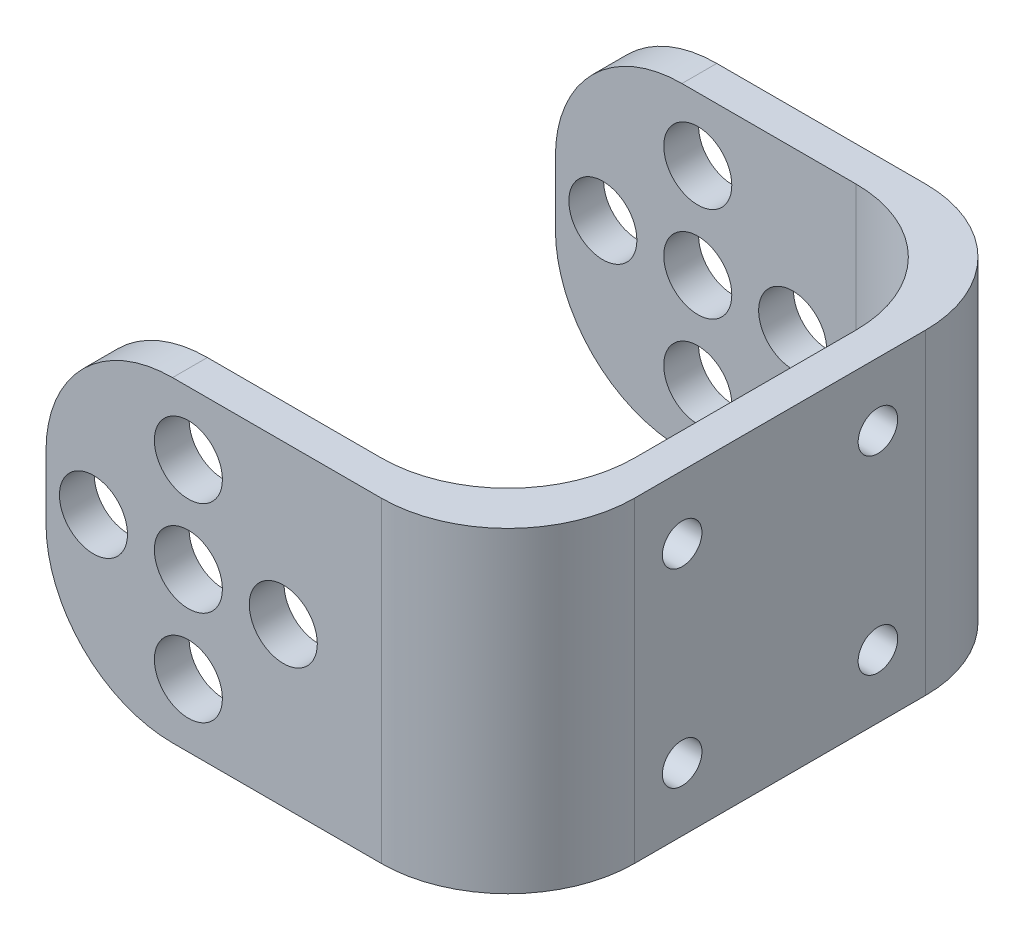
ISO-10303-21;
HEADER;
FILE_DESCRIPTION(('STEP AP214'),'2;1');
FILE_NAME('part.step','',(''),(''),'','','');
FILE_SCHEMA(('AUTOMOTIVE_DESIGN { 1 0 10303 214 1 1 1 1 }'));
ENDSEC;
DATA;
#1=APPLICATION_CONTEXT('core data for automotive mechanical design processes');
#2=APPLICATION_PROTOCOL_DEFINITION('international standard','automotive_design',2000,#1);
#3=PRODUCT_CONTEXT('',#1,'mechanical');
#4=PRODUCT('Part','Part','',(#3));
#5=PRODUCT_RELATED_PRODUCT_CATEGORY('part','',(#4));
#6=PRODUCT_DEFINITION_FORMATION('','',#4);
#7=PRODUCT_DEFINITION_CONTEXT('part definition',#1,'design');
#8=PRODUCT_DEFINITION('design','',#6,#7);
#9=PRODUCT_DEFINITION_SHAPE('','',#8);
#10=(LENGTH_UNIT() NAMED_UNIT(*) SI_UNIT(.MILLI.,.METRE.));
#11=(NAMED_UNIT(*) PLANE_ANGLE_UNIT() SI_UNIT($,.RADIAN.));
#12=(NAMED_UNIT(*) SI_UNIT($,.STERADIAN.) SOLID_ANGLE_UNIT());
#13=UNCERTAINTY_MEASURE_WITH_UNIT(LENGTH_MEASURE(1.E-05),#10,'distance_accuracy_value','');
#14=(GEOMETRIC_REPRESENTATION_CONTEXT(3) GLOBAL_UNCERTAINTY_ASSIGNED_CONTEXT((#13)) GLOBAL_UNIT_ASSIGNED_CONTEXT((#10,
#11,#12)) REPRESENTATION_CONTEXT('',''));
#15=CARTESIAN_POINT('',(0.,0.,0.));
#16=DIRECTION('',(0.,0.,1.));
#17=DIRECTION('',(1.,0.,0.));
#18=AXIS2_PLACEMENT_3D('',#15,#16,#17);
#19=CARTESIAN_POINT('',(-11.86,10.,-17.2));
#20=DIRECTION('',(1.,0.,0.));
#21=DIRECTION('',(0.,0.,-1.));
#22=AXIS2_PLACEMENT_3D('',#19,#20,#21);
#23=PLANE('',#22);
#24=DIRECTION('',(0.,0.,1.));
#25=VECTOR('',#24,1.);
#26=CARTESIAN_POINT('',(-11.86,-2.,-17.2));
#27=LINE('',#26,#25);
#28=CARTESIAN_POINT('',(-11.86,-2.,-17.2));
#29=VERTEX_POINT('',#28);
#30=CARTESIAN_POINT('',(-11.86,-2.,-15.));
#31=VERTEX_POINT('',#30);
#32=EDGE_CURVE('E352',#29,#31,#27,.T.);
#33=ORIENTED_EDGE('',*,*,#32,.T.);
#34=DIRECTION('',(0.,-1.,0.));
#35=VECTOR('',#34,1.);
#36=CARTESIAN_POINT('',(-11.86,10.,-15.));
#37=LINE('',#36,#35);
#38=CARTESIAN_POINT('',(-11.86,2.,-15.));
#39=VERTEX_POINT('',#38);
#40=EDGE_CURVE('E195',#39,#31,#37,.T.);
#41=ORIENTED_EDGE('',*,*,#40,.F.);
#42=DIRECTION('',(0.,0.,1.));
#43=VECTOR('',#42,1.);
#44=CARTESIAN_POINT('',(-11.86,2.,-17.2));
#45=LINE('',#44,#43);
#46=CARTESIAN_POINT('',(-11.86,2.,-17.2));
#47=VERTEX_POINT('',#46);
#48=EDGE_CURVE('E399',#47,#39,#45,.T.);
#49=ORIENTED_EDGE('',*,*,#48,.F.);
#50=DIRECTION('',(0.,-1.,0.));
#51=VECTOR('',#50,1.);
#52=CARTESIAN_POINT('',(-11.86,10.,-17.2));
#53=LINE('',#52,#51);
#54=EDGE_CURVE('E243',#47,#29,#53,.T.);
#55=ORIENTED_EDGE('',*,*,#54,.T.);
#56=EDGE_LOOP('',(#33,#41,#49,#55));
#57=FACE_BOUND('',#56,.T.);
#58=ADVANCED_FACE('F34',(#57),#23,.F.);
#59=CARTESIAN_POINT('',(-11.86,10.,17.2));
#60=DIRECTION('',(-1.,0.,0.));
#61=DIRECTION('',(0.,0.,1.));
#62=AXIS2_PLACEMENT_3D('',#59,#60,#61);
#63=PLANE('',#62);
#64=CARTESIAN_POINT('',(-11.86,-2.,15.));
#65=VERTEX_POINT('',#64);
#66=CARTESIAN_POINT('',(-11.86,-2.,17.2));
#67=VERTEX_POINT('',#66);
#68=EDGE_CURVE('E356',#65,#67,#27,.T.);
#69=ORIENTED_EDGE('',*,*,#68,.T.);
#70=DIRECTION('',(0.,-1.,0.));
#71=VECTOR('',#70,1.);
#72=CARTESIAN_POINT('',(-11.86,10.,17.2));
#73=LINE('',#72,#71);
#74=CARTESIAN_POINT('',(-11.86,2.,17.2));
#75=VERTEX_POINT('',#74);
#76=EDGE_CURVE('E283',#75,#67,#73,.T.);
#77=ORIENTED_EDGE('',*,*,#76,.F.);
#78=CARTESIAN_POINT('',(-11.86,2.,15.));
#79=VERTEX_POINT('',#78);
#80=EDGE_CURVE('E395',#79,#75,#45,.T.);
#81=ORIENTED_EDGE('',*,*,#80,.F.);
#82=DIRECTION('',(0.,-1.,0.));
#83=VECTOR('',#82,1.);
#84=CARTESIAN_POINT('',(-11.86,10.,15.));
#85=LINE('',#84,#83);
#86=EDGE_CURVE('E217',#79,#65,#85,.T.);
#87=ORIENTED_EDGE('',*,*,#86,.T.);
#88=EDGE_LOOP('',(#69,#77,#81,#87));
#89=FACE_BOUND('',#88,.T.);
#90=ADVANCED_FACE('F447',(#89),#63,.T.);
#91=CARTESIAN_POINT('',(-11.86,10.,-15.));
#92=DIRECTION('',(0.,0.,-1.));
#93=DIRECTION('',(-1.,0.,0.));
#94=AXIS2_PLACEMENT_3D('',#91,#92,#93);
#95=PLANE('',#94);
#96=CARTESIAN_POINT('',(-8.86,0.,-15.));
#97=DIRECTION('',(0.,0.,-1.));
#98=DIRECTION('',(-1.,0.,0.));
#99=AXIS2_PLACEMENT_3D('',#96,#97,#98);
#100=CIRCLE('',#99,2.15);
#101=CARTESIAN_POINT('',(-6.71,0.,-15.));
#102=VERTEX_POINT('',#101);
#103=EDGE_CURVE('E389',#102,#102,#100,.T.);
#104=ORIENTED_EDGE('',*,*,#103,.T.);
#105=EDGE_LOOP('',(#104));
#106=FACE_BOUND('',#105,.T.);
#107=CARTESIAN_POINT('',(3.14,0.,-15.));
#108=DIRECTION('',(0.,0.,-1.));
#109=DIRECTION('',(-1.,0.,0.));
#110=AXIS2_PLACEMENT_3D('',#107,#108,#109);
#111=CIRCLE('',#110,2.15);
#112=CARTESIAN_POINT('',(5.29,0.,-15.));
#113=VERTEX_POINT('',#112);
#114=EDGE_CURVE('E383',#113,#113,#111,.T.);
#115=ORIENTED_EDGE('',*,*,#114,.T.);
#116=EDGE_LOOP('',(#115));
#117=FACE_BOUND('',#116,.T.);
#118=CARTESIAN_POINT('',(-2.86,6.,-15.));
#119=DIRECTION('',(0.,0.,-1.));
#120=DIRECTION('',(-1.,0.,0.));
#121=AXIS2_PLACEMENT_3D('',#118,#119,#120);
#122=CIRCLE('',#121,2.15);
#123=CARTESIAN_POINT('',(-0.71,6.,-15.));
#124=VERTEX_POINT('',#123);
#125=EDGE_CURVE('E377',#124,#124,#122,.T.);
#126=ORIENTED_EDGE('',*,*,#125,.T.);
#127=EDGE_LOOP('',(#126));
#128=FACE_BOUND('',#127,.T.);
#129=CARTESIAN_POINT('',(-2.86,0.,-15.));
#130=DIRECTION('',(0.,0.,-1.));
#131=DIRECTION('',(-1.,0.,0.));
#132=AXIS2_PLACEMENT_3D('',#129,#130,#131);
#133=CIRCLE('',#132,2.15);
#134=CARTESIAN_POINT('',(-0.71,0.,-15.));
#135=VERTEX_POINT('',#134);
#136=EDGE_CURVE('E371',#135,#135,#133,.T.);
#137=ORIENTED_EDGE('',*,*,#136,.T.);
#138=EDGE_LOOP('',(#137));
#139=FACE_BOUND('',#138,.T.);
#140=CARTESIAN_POINT('',(-2.86,-6.,-15.));
#141=DIRECTION('',(0.,0.,-1.));
#142=DIRECTION('',(-1.,0.,0.));
#143=AXIS2_PLACEMENT_3D('',#140,#141,#142);
#144=CIRCLE('',#143,2.15);
#145=CARTESIAN_POINT('',(-0.71,-6.,-15.));
#146=VERTEX_POINT('',#145);
#147=EDGE_CURVE('E365',#146,#146,#144,.T.);
#148=ORIENTED_EDGE('',*,*,#147,.T.);
#149=EDGE_LOOP('',(#148));
#150=FACE_BOUND('',#149,.T.);
#151=ORIENTED_EDGE('',*,*,#40,.T.);
#152=CARTESIAN_POINT('',(-3.86,-2.,-15.));
#153=DIRECTION('',(0.,0.,-1.));
#154=DIRECTION('',(-1.,0.,0.));
#155=AXIS2_PLACEMENT_3D('',#152,#153,#154);
#156=CIRCLE('',#155,8.);
#157=CARTESIAN_POINT('',(-3.86,-10.,-15.));
#158=VERTEX_POINT('',#157);
#159=EDGE_CURVE('E359',#31,#158,#156,.F.);
#160=ORIENTED_EDGE('',*,*,#159,.T.);
#161=DIRECTION('',(1.,0.,0.));
#162=VECTOR('',#161,1.);
#163=CARTESIAN_POINT('',(-11.86,-10.,-15.));
#164=LINE('',#163,#162);
#165=CARTESIAN_POINT('',(7.14,-10.,-15.));
#166=VERTEX_POINT('',#165);
#167=EDGE_CURVE('E244',#158,#166,#164,.T.);
#168=ORIENTED_EDGE('',*,*,#167,.T.);
#169=DIRECTION('',(0.,-1.,0.));
#170=VECTOR('',#169,1.);
#171=CARTESIAN_POINT('',(7.14,10.,-15.));
#172=LINE('',#171,#170);
#173=CARTESIAN_POINT('',(7.14,10.,-15.));
#174=VERTEX_POINT('',#173);
#175=EDGE_CURVE('E188',#174,#166,#172,.T.);
#176=ORIENTED_EDGE('',*,*,#175,.F.);
#177=DIRECTION('',(1.,0.,0.));
#178=VECTOR('',#177,1.);
#179=CARTESIAN_POINT('',(-11.86,10.,-15.));
#180=LINE('',#179,#178);
#181=CARTESIAN_POINT('',(-3.86,10.,-15.));
#182=VERTEX_POINT('',#181);
#183=EDGE_CURVE('E270',#182,#174,#180,.T.);
#184=ORIENTED_EDGE('',*,*,#183,.F.);
#185=CARTESIAN_POINT('',(-3.86,2.,-15.));
#186=DIRECTION('',(0.,0.,-1.));
#187=DIRECTION('',(-1.,0.,0.));
#188=AXIS2_PLACEMENT_3D('',#185,#186,#187);
#189=CIRCLE('',#188,8.);
#190=EDGE_CURVE('E218',#182,#39,#189,.F.);
#191=ORIENTED_EDGE('',*,*,#190,.T.);
#192=EDGE_LOOP('',(#151,#160,#168,#176,#184,#191));
#193=FACE_BOUND('',#192,.T.);
#194=ADVANCED_FACE('F445',(#106,#117,#128,#139,#150,#193),#95,.F.);
#195=CARTESIAN_POINT('',(7.14,10.,-7.));
#196=DIRECTION('',(0.,-1.,0.));
#197=DIRECTION('',(0.,0.,-1.));
#198=AXIS2_PLACEMENT_3D('',#195,#196,#197);
#199=CYLINDRICAL_SURFACE('',#198,8.);
#200=CARTESIAN_POINT('',(15.14,6.94948986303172,-7.));
#201=CARTESIAN_POINT('',(15.1400001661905,6.92662686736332,-7.0267010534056));
#202=CARTESIAN_POINT('',(15.1398663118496,6.90264834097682,-7.05242424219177));
#203=CARTESIAN_POINT('',(15.1393907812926,6.85261450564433,-7.1017589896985));
#204=CARTESIAN_POINT('',(15.1390491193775,6.82655933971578,-7.12537069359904));
#205=CARTESIAN_POINT('',(15.1378040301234,6.74559149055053,-7.19273837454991));
#206=CARTESIAN_POINT('',(15.1366801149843,6.68780254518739,-7.23311306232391));
#207=CARTESIAN_POINT('',(15.1343158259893,6.56627916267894,-7.30358873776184));
#208=CARTESIAN_POINT('',(15.1330754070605,6.50254242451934,-7.33368572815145));
#209=CARTESIAN_POINT('',(15.1308760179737,6.37092211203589,-7.38276164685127));
#210=CARTESIAN_POINT('',(15.1299169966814,6.30303929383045,-7.40174259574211));
#211=CARTESIAN_POINT('',(15.1285509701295,6.16500547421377,-7.42805342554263));
#212=CARTESIAN_POINT('',(15.1281443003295,6.09485312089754,-7.43537622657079));
#213=CARTESIAN_POINT('',(15.127993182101,5.95431050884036,-7.43814031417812));
#214=CARTESIAN_POINT('',(15.1282487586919,5.88392024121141,-7.43358115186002));
#215=CARTESIAN_POINT('',(15.129353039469,5.74502345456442,-7.41272894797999));
#216=CARTESIAN_POINT('',(15.1302007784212,5.67651405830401,-7.39645500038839));
#217=CARTESIAN_POINT('',(15.1322536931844,5.54316194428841,-7.35264383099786));
#218=CARTESIAN_POINT('',(15.1334590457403,5.47832105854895,-7.32510103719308));
#219=CARTESIAN_POINT('',(15.135858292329,5.35405469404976,-7.25947663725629));
#220=CARTESIAN_POINT('',(15.1370521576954,5.29464062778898,-7.22137347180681));
#221=CARTESIAN_POINT('',(15.1389611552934,5.18315548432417,-7.13577942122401));
#222=CARTESIAN_POINT('',(15.1396773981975,5.1310675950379,-7.08831065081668));
#223=CARTESIAN_POINT('',(15.1399707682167,5.07217700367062,-7.02480621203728));
#224=CARTESIAN_POINT('',(15.1400001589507,5.06121689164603,-7.01250727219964));
#225=CARTESIAN_POINT('',(15.14,5.05051013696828,-7.));
#226=B_SPLINE_CURVE_WITH_KNOTS('',3,(#200,#201,#202,#203,#204,#205,#206,#207,#208,#209,#210,
#211,#212,#213,#214,#215,#216,#217,#218,#219,#220,#221,#222,#223,#224,#225),.UNSPECIFIED.,.F.,
.F.,(4,2,2,2,2,2,2,2,2,2,2,2,4),(0.,0.105390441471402,0.210773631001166,0.421203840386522,
0.631715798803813,0.842189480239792,1.05279093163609,1.26340033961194,1.4736672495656,
1.68403825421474,1.8948419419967,2.10515369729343,2.15456092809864),.UNSPECIFIED.);
#227=CARTESIAN_POINT('',(15.14,6.94948986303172,-7.));
#228=VERTEX_POINT('',#227);
#229=CARTESIAN_POINT('',(15.14,5.05051013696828,-7.));
#230=VERTEX_POINT('',#229);
#231=EDGE_CURVE('E54',#228,#230,#226,.T.);
#232=ORIENTED_EDGE('',*,*,#231,.F.);
#233=DIRECTION('',(0.,-1.,0.));
#234=VECTOR('',#233,1.);
#235=CARTESIAN_POINT('',(15.14,10.,-7.));
#236=LINE('',#235,#234);
#237=CARTESIAN_POINT('',(15.14,10.,-7.));
#238=VERTEX_POINT('',#237);
#239=EDGE_CURVE('E186',#238,#228,#236,.T.);
#240=ORIENTED_EDGE('',*,*,#239,.F.);
#241=CARTESIAN_POINT('',(7.14,10.,-7.));
#242=DIRECTION('',(0.,1.,0.));
#243=DIRECTION('',(0.,0.,1.));
#244=AXIS2_PLACEMENT_3D('',#241,#242,#243);
#245=CIRCLE('',#244,8.);
#246=EDGE_CURVE('E404',#238,#174,#245,.T.);
#247=ORIENTED_EDGE('',*,*,#246,.T.);
#248=ORIENTED_EDGE('',*,*,#175,.T.);
#249=CARTESIAN_POINT('',(7.14,-10.,-7.));
#250=DIRECTION('',(0.,1.,0.));
#251=DIRECTION('',(0.,0.,1.));
#252=AXIS2_PLACEMENT_3D('',#249,#250,#251);
#253=CIRCLE('',#252,8.);
#254=CARTESIAN_POINT('',(15.14,-10.,-7.));
#255=VERTEX_POINT('',#254);
#256=EDGE_CURVE('E246',#255,#166,#253,.T.);
#257=ORIENTED_EDGE('',*,*,#256,.F.);
#258=CARTESIAN_POINT('',(15.14,-6.94948986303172,-7.));
#259=VERTEX_POINT('',#258);
#260=EDGE_CURVE('E180',#259,#255,#236,.T.);
#261=ORIENTED_EDGE('',*,*,#260,.F.);
#262=CARTESIAN_POINT('',(15.14,-5.05051013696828,-7.));
#263=CARTESIAN_POINT('',(15.1400001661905,-5.07337313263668,-7.0267010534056));
#264=CARTESIAN_POINT('',(15.1398663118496,-5.09735165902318,-7.05242424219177));
#265=CARTESIAN_POINT('',(15.1393907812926,-5.14738549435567,-7.1017589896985));
#266=CARTESIAN_POINT('',(15.1390491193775,-5.17344066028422,-7.12537069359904));
#267=CARTESIAN_POINT('',(15.1378040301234,-5.25440850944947,-7.19273837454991));
#268=CARTESIAN_POINT('',(15.1366801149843,-5.31219745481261,-7.23311306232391));
#269=CARTESIAN_POINT('',(15.1343158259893,-5.43372083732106,-7.30358873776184));
#270=CARTESIAN_POINT('',(15.1330754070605,-5.49745757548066,-7.33368572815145));
#271=CARTESIAN_POINT('',(15.1308760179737,-5.62907788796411,-7.38276164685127));
#272=CARTESIAN_POINT('',(15.1299169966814,-5.69696070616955,-7.40174259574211));
#273=CARTESIAN_POINT('',(15.1285509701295,-5.83499452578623,-7.42805342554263));
#274=CARTESIAN_POINT('',(15.1281443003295,-5.90514687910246,-7.43537622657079));
#275=CARTESIAN_POINT('',(15.127993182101,-6.04568949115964,-7.43814031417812));
#276=CARTESIAN_POINT('',(15.1282487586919,-6.11607975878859,-7.43358115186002));
#277=CARTESIAN_POINT('',(15.129353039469,-6.25497654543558,-7.41272894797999));
#278=CARTESIAN_POINT('',(15.1302007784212,-6.32348594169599,-7.39645500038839));
#279=CARTESIAN_POINT('',(15.1322536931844,-6.45683805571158,-7.35264383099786));
#280=CARTESIAN_POINT('',(15.1334590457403,-6.52167894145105,-7.32510103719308));
#281=CARTESIAN_POINT('',(15.135858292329,-6.64594530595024,-7.25947663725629));
#282=CARTESIAN_POINT('',(15.1370521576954,-6.70535937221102,-7.22137347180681));
#283=CARTESIAN_POINT('',(15.1389611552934,-6.81684451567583,-7.13577942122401));
#284=CARTESIAN_POINT('',(15.1396773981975,-6.8689324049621,-7.08831065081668));
#285=CARTESIAN_POINT('',(15.1399707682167,-6.92782299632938,-7.02480621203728));
#286=CARTESIAN_POINT('',(15.1400001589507,-6.93878310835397,-7.01250727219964));
#287=CARTESIAN_POINT('',(15.14,-6.94948986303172,-7.));
#288=B_SPLINE_CURVE_WITH_KNOTS('',3,(#262,#263,#264,#265,#266,#267,#268,#269,#270,#271,#272,
#273,#274,#275,#276,#277,#278,#279,#280,#281,#282,#283,#284,#285,#286,#287),.UNSPECIFIED.,.F.,
.F.,(4,2,2,2,2,2,2,2,2,2,2,2,4),(0.,0.105390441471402,0.210773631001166,0.421203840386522,
0.631715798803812,0.842189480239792,1.05279093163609,1.26340033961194,1.4736672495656,
1.68403825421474,1.8948419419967,2.10515369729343,2.15456092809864),.UNSPECIFIED.);
#289=CARTESIAN_POINT('',(15.14,-5.05051013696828,-7.));
#290=VERTEX_POINT('',#289);
#291=EDGE_CURVE('E47',#290,#259,#288,.T.);
#292=ORIENTED_EDGE('',*,*,#291,.F.);
#293=EDGE_CURVE('E178',#230,#290,#236,.T.);
#294=ORIENTED_EDGE('',*,*,#293,.F.);
#295=EDGE_LOOP('',(#232,#240,#247,#248,#257,#261,#292,#294));
#296=FACE_BOUND('',#295,.T.);
#297=ADVANCED_FACE('F177',(#296),#199,.F.);
#298=CARTESIAN_POINT('',(15.14,10.,-7.));
#299=DIRECTION('',(1.,0.,0.));
#300=DIRECTION('',(0.,0.,-1.));
#301=AXIS2_PLACEMENT_3D('',#298,#299,#300);
#302=PLANE('',#301);
#303=ORIENTED_EDGE('',*,*,#239,.T.);
#304=CARTESIAN_POINT('',(15.14,6.,-6.187));
#305=DIRECTION('',(1.,0.,0.));
#306=DIRECTION('',(0.,0.,-1.));
#307=AXIS2_PLACEMENT_3D('',#304,#305,#306);
#308=CIRCLE('',#307,1.25);
#309=EDGE_CURVE('E185',#228,#230,#308,.T.);
#310=ORIENTED_EDGE('',*,*,#309,.T.);
#311=ORIENTED_EDGE('',*,*,#293,.T.);
#312=CARTESIAN_POINT('',(15.14,-6.,-6.187));
#313=DIRECTION('',(1.,0.,0.));
#314=DIRECTION('',(0.,0.,-1.));
#315=AXIS2_PLACEMENT_3D('',#312,#313,#314);
#316=CIRCLE('',#315,1.25);
#317=EDGE_CURVE('E167',#290,#259,#316,.T.);
#318=ORIENTED_EDGE('',*,*,#317,.T.);
#319=ORIENTED_EDGE('',*,*,#260,.T.);
#320=DIRECTION('',(0.,0.,1.));
#321=VECTOR('',#320,1.);
#322=CARTESIAN_POINT('',(15.14,-10.,-7.));
#323=LINE('',#322,#321);
#324=CARTESIAN_POINT('',(15.14,-10.,7.));
#325=VERTEX_POINT('',#324);
#326=EDGE_CURVE('E249',#255,#325,#323,.T.);
#327=ORIENTED_EDGE('',*,*,#326,.T.);
#328=DIRECTION('',(0.,-1.,0.));
#329=VECTOR('',#328,1.);
#330=CARTESIAN_POINT('',(15.14,10.,7.));
#331=LINE('',#330,#329);
#332=CARTESIAN_POINT('',(15.14,-6.94948986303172,7.));
#333=VERTEX_POINT('',#332);
#334=EDGE_CURVE('E287',#333,#325,#331,.T.);
#335=ORIENTED_EDGE('',*,*,#334,.F.);
#336=CARTESIAN_POINT('',(15.14,-6.,6.187));
#337=DIRECTION('',(1.,0.,0.));
#338=DIRECTION('',(0.,0.,-1.));
#339=AXIS2_PLACEMENT_3D('',#336,#337,#338);
#340=CIRCLE('',#339,1.25);
#341=CARTESIAN_POINT('',(15.14,-5.05051013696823,7.00000000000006));
#342=VERTEX_POINT('',#341);
#343=EDGE_CURVE('E410',#333,#342,#340,.T.);
#344=ORIENTED_EDGE('',*,*,#343,.T.);
#345=CARTESIAN_POINT('',(15.14,5.05051013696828,7.));
#346=VERTEX_POINT('',#345);
#347=EDGE_CURVE('E289',#346,#342,#331,.T.);
#348=ORIENTED_EDGE('',*,*,#347,.F.);
#349=CARTESIAN_POINT('',(15.14,6.,6.187));
#350=DIRECTION('',(1.,0.,0.));
#351=DIRECTION('',(0.,0.,-1.));
#352=AXIS2_PLACEMENT_3D('',#349,#350,#351);
#353=CIRCLE('',#352,1.25);
#354=CARTESIAN_POINT('',(15.14,6.94948986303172,7.));
#355=VERTEX_POINT('',#354);
#356=EDGE_CURVE('E303',#346,#355,#353,.T.);
#357=ORIENTED_EDGE('',*,*,#356,.T.);
#358=CARTESIAN_POINT('',(15.14,10.,7.));
#359=VERTEX_POINT('',#358);
#360=EDGE_CURVE('E189',#359,#355,#331,.T.);
#361=ORIENTED_EDGE('',*,*,#360,.F.);
#362=DIRECTION('',(0.,0.,1.));
#363=VECTOR('',#362,1.);
#364=CARTESIAN_POINT('',(15.14,10.,-7.));
#365=LINE('',#364,#363);
#366=EDGE_CURVE('E229',#238,#359,#365,.T.);
#367=ORIENTED_EDGE('',*,*,#366,.F.);
#368=EDGE_LOOP('',(#303,#310,#311,#318,#319,#327,#335,#344,#348,#357,#361,#367));
#369=FACE_BOUND('',#368,.T.);
#370=ADVANCED_FACE('F184',(#369),#302,.F.);
#371=CARTESIAN_POINT('',(7.14,10.,7.));
#372=DIRECTION('',(0.,-1.,0.));
#373=DIRECTION('',(0.,0.,-1.));
#374=AXIS2_PLACEMENT_3D('',#371,#372,#373);
#375=CYLINDRICAL_SURFACE('',#374,8.);
#376=ORIENTED_EDGE('',*,*,#347,.T.);
#377=CARTESIAN_POINT('',(14.8694263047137,-6.,4.937));
#378=CARTESIAN_POINT('',(14.8694278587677,-5.93124443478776,4.93700298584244));
#379=CARTESIAN_POINT('',(14.8709530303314,-5.86244933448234,4.94269417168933));
#380=CARTESIAN_POINT('',(14.8769268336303,-5.72681197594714,4.96527789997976));
#381=CARTESIAN_POINT('',(14.8813783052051,-5.65997168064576,4.98218132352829));
#382=CARTESIAN_POINT('',(14.892819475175,-5.53025334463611,5.02659891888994));
#383=CARTESIAN_POINT('',(14.8998056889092,-5.46737000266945,5.05409852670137));
#384=CARTESIAN_POINT('',(14.9157567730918,-5.34714013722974,5.11885313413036));
#385=CARTESIAN_POINT('',(14.9247215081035,-5.28979323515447,5.15610746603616));
#386=CARTESIAN_POINT('',(14.9441471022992,-5.18101815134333,5.24012007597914));
#387=CARTESIAN_POINT('',(14.9546334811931,-5.12972544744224,5.28704778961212));
#388=CARTESIAN_POINT('',(14.9762166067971,-5.03565812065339,5.38866408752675));
#389=CARTESIAN_POINT('',(14.987313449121,-4.99288483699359,5.4433538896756));
#390=CARTESIAN_POINT('',(15.0096552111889,-4.91601508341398,5.56049892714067));
#391=CARTESIAN_POINT('',(15.020897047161,-4.88215824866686,5.62311223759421));
#392=CARTESIAN_POINT('',(15.042536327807,-4.82550413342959,5.75329654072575));
#393=CARTESIAN_POINT('',(15.0529337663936,-4.80270693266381,5.82086756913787));
#394=CARTESIAN_POINT('',(15.0722922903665,-4.76890801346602,5.95903981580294));
#395=CARTESIAN_POINT('',(15.0812545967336,-4.75789622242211,6.02963839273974));
#396=CARTESIAN_POINT('',(15.0973454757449,-4.7480604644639,6.17188565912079));
#397=CARTESIAN_POINT('',(15.1044742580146,-4.74923510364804,6.24353422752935));
#398=CARTESIAN_POINT('',(15.1165938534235,-4.76370254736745,6.38447853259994));
#399=CARTESIAN_POINT('',(15.1216205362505,-4.77677880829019,6.45379344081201));
#400=CARTESIAN_POINT('',(15.1297416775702,-4.81443368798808,6.58934239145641));
#401=CARTESIAN_POINT('',(15.1328362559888,-4.8390115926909,6.65557662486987));
#402=CARTESIAN_POINT('',(15.1372859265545,-4.89864745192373,6.78229085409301));
#403=CARTESIAN_POINT('',(15.1386602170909,-4.93358425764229,6.84282725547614));
#404=CARTESIAN_POINT('',(15.1400907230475,-5.01305305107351,6.95725186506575));
#405=CARTESIAN_POINT('',(15.140146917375,-5.05758519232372,7.0111399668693));
#406=CARTESIAN_POINT('',(15.1393877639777,-5.15512366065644,7.11088474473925));
#407=CARTESIAN_POINT('',(15.138570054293,-5.20815262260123,7.15671926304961));
#408=CARTESIAN_POINT('',(15.1365382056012,-5.32110943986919,7.2388964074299));
#409=CARTESIAN_POINT('',(15.1353240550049,-5.38103749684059,7.2752387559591));
#410=CARTESIAN_POINT('',(15.1329353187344,-5.50647238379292,7.33759261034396));
#411=CARTESIAN_POINT('',(15.1317609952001,-5.57200880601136,7.3635446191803));
#412=CARTESIAN_POINT('',(15.1298141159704,-5.70651228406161,7.4040861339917));
#413=CARTESIAN_POINT('',(15.1290415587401,-5.77547932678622,7.41867568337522));
#414=CARTESIAN_POINT('',(15.1281107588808,-5.91490595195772,7.43607797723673));
#415=CARTESIAN_POINT('',(15.1279526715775,-5.98536590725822,7.4388877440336));
#416=CARTESIAN_POINT('',(15.1282933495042,-6.1257560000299,7.43264141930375));
#417=CARTESIAN_POINT('',(15.1287921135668,-6.19568613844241,7.42358534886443));
#418=CARTESIAN_POINT('',(15.1303112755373,-6.33295483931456,7.39388323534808));
#419=CARTESIAN_POINT('',(15.1313311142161,-6.4002960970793,7.37324961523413));
#420=CARTESIAN_POINT('',(15.1336003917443,-6.53056432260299,7.320987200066));
#421=CARTESIAN_POINT('',(15.134849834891,-6.59349120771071,7.28935819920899));
#422=CARTESIAN_POINT('',(15.1371690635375,-6.71323973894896,7.21594521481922));
#423=CARTESIAN_POINT('',(15.1382385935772,-6.77005266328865,7.17414699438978));
#424=CARTESIAN_POINT('',(15.1397173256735,-6.87586018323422,7.08159977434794));
#425=CARTESIAN_POINT('',(15.1401265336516,-6.92485484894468,7.03085085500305));
#426=CARTESIAN_POINT('',(15.1398037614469,-7.01356769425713,6.92192020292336));
#427=CARTESIAN_POINT('',(15.1390733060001,-7.05329818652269,6.86374849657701));
#428=CARTESIAN_POINT('',(15.1360587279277,-7.1224281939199,6.74159821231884));
#429=CARTESIAN_POINT('',(15.1337746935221,-7.1518282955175,6.6776199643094));
#430=CARTESIAN_POINT('',(15.1273841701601,-7.19932512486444,6.54613163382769));
#431=CARTESIAN_POINT('',(15.1232890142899,-7.21749048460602,6.4786457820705));
#432=CARTESIAN_POINT('',(15.1131673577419,-7.24233545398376,6.34173561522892));
#433=CARTESIAN_POINT('',(15.1071408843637,-7.24901522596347,6.27231132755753));
#434=CARTESIAN_POINT('',(15.0932446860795,-7.25078191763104,6.13353582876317));
#435=CARTESIAN_POINT('',(15.0853757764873,-7.2458739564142,6.06418459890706));
#436=CARTESIAN_POINT('',(15.0680743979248,-7.2247105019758,5.92743805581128));
#437=CARTESIAN_POINT('',(15.0586418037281,-7.20845409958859,5.86004289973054));
#438=CARTESIAN_POINT('',(15.0385302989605,-7.16481902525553,5.72809732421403));
#439=CARTESIAN_POINT('',(15.027835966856,-7.137289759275,5.66359908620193));
#440=CARTESIAN_POINT('',(15.005927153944,-7.07190529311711,5.54016280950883));
#441=CARTESIAN_POINT('',(14.9947126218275,-7.03404907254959,5.48122532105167));
#442=CARTESIAN_POINT('',(14.9722979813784,-6.9483100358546,5.36953677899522));
#443=CARTESIAN_POINT('',(14.9611012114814,-6.90027101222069,5.3169048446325));
#444=CARTESIAN_POINT('',(14.9397207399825,-6.79582132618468,5.22044854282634));
#445=CARTESIAN_POINT('',(14.9295372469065,-6.73940894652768,5.1766259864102));
#446=CARTESIAN_POINT('',(14.9110142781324,-6.61992866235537,5.09923166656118));
#447=CARTESIAN_POINT('',(14.9026690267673,-6.55688255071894,5.06562766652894));
#448=CARTESIAN_POINT('',(14.8884937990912,-6.42579321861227,5.00960127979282));
#449=CARTESIAN_POINT('',(14.8826607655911,-6.35775619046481,4.98716529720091));
#450=CARTESIAN_POINT('',(14.87540988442,-6.24112893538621,4.95951940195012));
#451=CARTESIAN_POINT('',(14.8731752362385,-6.19332760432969,4.95108935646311));
#452=CARTESIAN_POINT('',(14.8701829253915,-6.0970240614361,4.93982870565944));
#453=CARTESIAN_POINT('',(14.8694252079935,-6.04852187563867,4.93699789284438));
#454=CARTESIAN_POINT('',(14.8694263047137,-6.,4.937));
#455=B_SPLINE_CURVE_WITH_KNOTS('',3,(#377,#378,#379,#380,#381,#382,#383,#384,#385,#386,#387,
#388,#389,#390,#391,#392,#393,#394,#395,#396,#397,#398,#399,#400,#401,#402,#403,#404,#405,#406,
#407,#408,#409,#410,#411,#412,#413,#414,#415,#416,#417,#418,#419,#420,#421,#422,#423,#424,#425,
#426,#427,#428,#429,#430,#431,#432,#433,#434,#435,#436,#437,#438,#439,#440,#441,#442,#443,#444,
#445,#446,#447,#448,#449,#450,#451,#452,#453,#454),.UNSPECIFIED.,.T.,.F.,(4,2,2,2,2,2,2,2,2,2,2,
2,2,2,2,2,2,2,2,2,2,2,2,2,2,2,2,2,2,2,2,2,2,2,2,2,2,2,4),(0.,0.206086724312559,
0.412373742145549,0.618378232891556,0.824368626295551,1.03433173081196,1.2443278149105,
1.45949566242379,1.6746650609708,1.88965041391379,2.10461117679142,2.31573736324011,
2.52685044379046,2.73558586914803,2.94432463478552,3.1536290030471,3.36293949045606,
3.57343195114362,3.78392360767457,3.99446846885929,4.20501295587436,4.41533195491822,
4.62565489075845,4.83627399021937,5.04689120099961,5.25722687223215,5.46755060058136,
5.67657645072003,5.88559934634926,6.09452991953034,6.30347723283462,6.51531198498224,
6.72716767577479,6.94254494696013,7.15796645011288,7.37270113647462,7.58717376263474,
7.732617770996,7.87805638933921),.UNSPECIFIED.);
#456=EDGE_CURVE('E181',#342,#333,#455,.T.);
#457=ORIENTED_EDGE('',*,*,#456,.T.);
#458=ORIENTED_EDGE('',*,*,#334,.T.);
#459=CARTESIAN_POINT('',(7.14,-10.,7.));
#460=DIRECTION('',(0.,-1.,0.));
#461=DIRECTION('',(0.,0.,-1.));
#462=AXIS2_PLACEMENT_3D('',#459,#460,#461);
#463=CIRCLE('',#462,8.);
#464=CARTESIAN_POINT('',(7.14,-10.,15.));
#465=VERTEX_POINT('',#464);
#466=EDGE_CURVE('E252',#325,#465,#463,.T.);
#467=ORIENTED_EDGE('',*,*,#466,.T.);
#468=DIRECTION('',(0.,-1.,0.));
#469=VECTOR('',#468,1.);
#470=CARTESIAN_POINT('',(7.14,10.,15.));
#471=LINE('',#470,#469);
#472=CARTESIAN_POINT('',(7.14,10.,15.));
#473=VERTEX_POINT('',#472);
#474=EDGE_CURVE('E286',#473,#465,#471,.T.);
#475=ORIENTED_EDGE('',*,*,#474,.F.);
#476=CARTESIAN_POINT('',(7.14,10.,7.));
#477=DIRECTION('',(0.,-1.,0.));
#478=DIRECTION('',(0.,0.,-1.));
#479=AXIS2_PLACEMENT_3D('',#476,#477,#478);
#480=CIRCLE('',#479,8.);
#481=EDGE_CURVE('E223',#359,#473,#480,.T.);
#482=ORIENTED_EDGE('',*,*,#481,.F.);
#483=ORIENTED_EDGE('',*,*,#360,.T.);
#484=CARTESIAN_POINT('',(15.14,6.94948986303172,7.));
#485=CARTESIAN_POINT('',(15.1400001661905,6.92662686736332,7.0267010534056));
#486=CARTESIAN_POINT('',(15.1398663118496,6.90264834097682,7.05242424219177));
#487=CARTESIAN_POINT('',(15.1393907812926,6.85261450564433,7.1017589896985));
#488=CARTESIAN_POINT('',(15.1390491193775,6.82655933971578,7.12537069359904));
#489=CARTESIAN_POINT('',(15.1378040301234,6.74559149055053,7.19273837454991));
#490=CARTESIAN_POINT('',(15.1366801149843,6.68780254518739,7.23311306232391));
#491=CARTESIAN_POINT('',(15.1343158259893,6.56627916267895,7.30358873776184));
#492=CARTESIAN_POINT('',(15.1330754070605,6.50254242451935,7.33368572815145));
#493=CARTESIAN_POINT('',(15.1308760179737,6.37092211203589,7.38276164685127));
#494=CARTESIAN_POINT('',(15.1299169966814,6.30303929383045,7.40174259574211));
#495=CARTESIAN_POINT('',(15.1285509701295,6.16500547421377,7.42805342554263));
#496=CARTESIAN_POINT('',(15.1281443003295,6.09485312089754,7.43537622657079));
#497=CARTESIAN_POINT('',(15.127993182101,5.95431050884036,7.43814031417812));
#498=CARTESIAN_POINT('',(15.1282487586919,5.88392024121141,7.43358115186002));
#499=CARTESIAN_POINT('',(15.129353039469,5.74502345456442,7.41272894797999));
#500=CARTESIAN_POINT('',(15.1302007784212,5.67651405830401,7.39645500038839));
#501=CARTESIAN_POINT('',(15.1322536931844,5.54316194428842,7.35264383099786));
#502=CARTESIAN_POINT('',(15.1334590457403,5.47832105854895,7.32510103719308));
#503=CARTESIAN_POINT('',(15.135858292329,5.35405469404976,7.25947663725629));
#504=CARTESIAN_POINT('',(15.1370521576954,5.29464062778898,7.22137347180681));
#505=CARTESIAN_POINT('',(15.1389611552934,5.18315548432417,7.13577942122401));
#506=CARTESIAN_POINT('',(15.1396773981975,5.1310675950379,7.08831065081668));
#507=CARTESIAN_POINT('',(15.1399707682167,5.07217700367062,7.02480621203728));
#508=CARTESIAN_POINT('',(15.1400001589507,5.06121689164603,7.01250727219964));
#509=CARTESIAN_POINT('',(15.14,5.05051013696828,7.));
#510=B_SPLINE_CURVE_WITH_KNOTS('',3,(#484,#485,#486,#487,#488,#489,#490,#491,#492,#493,#494,
#495,#496,#497,#498,#499,#500,#501,#502,#503,#504,#505,#506,#507,#508,#509),.UNSPECIFIED.,.F.,
.F.,(4,2,2,2,2,2,2,2,2,2,2,2,4),(0.,0.105390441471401,0.210773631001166,0.421203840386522,
0.631715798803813,0.842189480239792,1.05279093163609,1.26340033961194,1.4736672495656,
1.68403825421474,1.8948419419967,2.10515369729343,2.15456092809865),.UNSPECIFIED.);
#511=EDGE_CURVE('E298',#355,#346,#510,.T.);
#512=ORIENTED_EDGE('',*,*,#511,.T.);
#513=EDGE_LOOP('',(#376,#457,#458,#467,#475,#482,#483,#512));
#514=FACE_BOUND('',#513,.T.);
#515=ADVANCED_FACE('F297',(#514),#375,.F.);
#516=CARTESIAN_POINT('',(-11.86,10.,15.));
#517=DIRECTION('',(0.,0.,-1.));
#518=DIRECTION('',(-1.,0.,0.));
#519=AXIS2_PLACEMENT_3D('',#516,#517,#518);
#520=PLANE('',#519);
#521=CARTESIAN_POINT('',(-8.86,0.,15.));
#522=DIRECTION('',(0.,0.,-1.));
#523=DIRECTION('',(-1.,0.,0.));
#524=AXIS2_PLACEMENT_3D('',#521,#522,#523);
#525=CIRCLE('',#524,2.15);
#526=CARTESIAN_POINT('',(-6.71,0.,15.));
#527=VERTEX_POINT('',#526);
#528=EDGE_CURVE('E386',#527,#527,#525,.T.);
#529=ORIENTED_EDGE('',*,*,#528,.F.);
#530=EDGE_LOOP('',(#529));
#531=FACE_BOUND('',#530,.T.);
#532=CARTESIAN_POINT('',(3.14,0.,15.));
#533=DIRECTION('',(0.,0.,-1.));
#534=DIRECTION('',(-1.,0.,0.));
#535=AXIS2_PLACEMENT_3D('',#532,#533,#534);
#536=CIRCLE('',#535,2.15);
#537=CARTESIAN_POINT('',(5.29,0.,15.));
#538=VERTEX_POINT('',#537);
#539=EDGE_CURVE('E380',#538,#538,#536,.T.);
#540=ORIENTED_EDGE('',*,*,#539,.F.);
#541=EDGE_LOOP('',(#540));
#542=FACE_BOUND('',#541,.T.);
#543=CARTESIAN_POINT('',(-2.86,6.,15.));
#544=DIRECTION('',(0.,0.,-1.));
#545=DIRECTION('',(-1.,0.,0.));
#546=AXIS2_PLACEMENT_3D('',#543,#544,#545);
#547=CIRCLE('',#546,2.15);
#548=CARTESIAN_POINT('',(-0.71,6.,15.));
#549=VERTEX_POINT('',#548);
#550=EDGE_CURVE('E374',#549,#549,#547,.T.);
#551=ORIENTED_EDGE('',*,*,#550,.F.);
#552=EDGE_LOOP('',(#551));
#553=FACE_BOUND('',#552,.T.);
#554=CARTESIAN_POINT('',(-3.86,-2.,15.));
#555=DIRECTION('',(0.,0.,-1.));
#556=DIRECTION('',(-1.,0.,0.));
#557=AXIS2_PLACEMENT_3D('',#554,#555,#556);
#558=CIRCLE('',#557,8.);
#559=CARTESIAN_POINT('',(-3.86,-10.,15.));
#560=VERTEX_POINT('',#559);
#561=EDGE_CURVE('E355',#65,#560,#558,.F.);
#562=ORIENTED_EDGE('',*,*,#561,.F.);
#563=ORIENTED_EDGE('',*,*,#86,.F.);
#564=CARTESIAN_POINT('',(-3.86,2.,15.));
#565=DIRECTION('',(0.,0.,-1.));
#566=DIRECTION('',(-1.,0.,0.));
#567=AXIS2_PLACEMENT_3D('',#564,#565,#566);
#568=CIRCLE('',#567,8.);
#569=CARTESIAN_POINT('',(-3.86,10.,15.));
#570=VERTEX_POINT('',#569);
#571=EDGE_CURVE('E201',#570,#79,#568,.F.);
#572=ORIENTED_EDGE('',*,*,#571,.F.);
#573=DIRECTION('',(1.,0.,0.));
#574=VECTOR('',#573,1.);
#575=CARTESIAN_POINT('',(-11.86,10.,15.));
#576=LINE('',#575,#574);
#577=EDGE_CURVE('E214',#570,#473,#576,.T.);
#578=ORIENTED_EDGE('',*,*,#577,.T.);
#579=ORIENTED_EDGE('',*,*,#474,.T.);
#580=DIRECTION('',(1.,0.,0.));
#581=VECTOR('',#580,1.);
#582=CARTESIAN_POINT('',(-11.86,-10.,15.));
#583=LINE('',#582,#581);
#584=EDGE_CURVE('E255',#560,#465,#583,.T.);
#585=ORIENTED_EDGE('',*,*,#584,.F.);
#586=EDGE_LOOP('',(#562,#563,#572,#578,#579,#585));
#587=FACE_BOUND('',#586,.T.);
#588=CARTESIAN_POINT('',(-2.86,0.,15.));
#589=DIRECTION('',(0.,0.,-1.));
#590=DIRECTION('',(-1.,0.,0.));
#591=AXIS2_PLACEMENT_3D('',#588,#589,#590);
#592=CIRCLE('',#591,2.15);
#593=CARTESIAN_POINT('',(-0.71,0.,15.));
#594=VERTEX_POINT('',#593);
#595=EDGE_CURVE('E368',#594,#594,#592,.T.);
#596=ORIENTED_EDGE('',*,*,#595,.F.);
#597=EDGE_LOOP('',(#596));
#598=FACE_BOUND('',#597,.T.);
#599=CARTESIAN_POINT('',(-2.86,-6.,15.));
#600=DIRECTION('',(0.,0.,-1.));
#601=DIRECTION('',(-1.,0.,0.));
#602=AXIS2_PLACEMENT_3D('',#599,#600,#601);
#603=CIRCLE('',#602,2.15);
#604=CARTESIAN_POINT('',(-0.71,-6.,15.));
#605=VERTEX_POINT('',#604);
#606=EDGE_CURVE('E362',#605,#605,#603,.T.);
#607=ORIENTED_EDGE('',*,*,#606,.F.);
#608=EDGE_LOOP('',(#607));
#609=FACE_BOUND('',#608,.T.);
#610=ADVANCED_FACE('F211',(#531,#542,#553,#587,#598,#609),#520,.T.);
#611=CARTESIAN_POINT('',(-11.86,10.,17.2));
#612=DIRECTION('',(0.,0.,-1.));
#613=DIRECTION('',(-1.,0.,0.));
#614=AXIS2_PLACEMENT_3D('',#611,#612,#613);
#615=PLANE('',#614);
#616=CARTESIAN_POINT('',(-8.86,0.,17.2));
#617=DIRECTION('',(0.,0.,1.));
#618=DIRECTION('',(1.,0.,0.));
#619=AXIS2_PLACEMENT_3D('',#616,#617,#618);
#620=CIRCLE('',#619,2.15);
#621=CARTESIAN_POINT('',(-6.71,0.,17.2));
#622=VERTEX_POINT('',#621);
#623=EDGE_CURVE('E306',#622,#622,#620,.T.);
#624=ORIENTED_EDGE('',*,*,#623,.F.);
#625=EDGE_LOOP('',(#624));
#626=FACE_BOUND('',#625,.T.);
#627=CARTESIAN_POINT('',(3.14,0.,17.2));
#628=DIRECTION('',(0.,0.,1.));
#629=DIRECTION('',(1.,0.,0.));
#630=AXIS2_PLACEMENT_3D('',#627,#628,#629);
#631=CIRCLE('',#630,2.15);
#632=CARTESIAN_POINT('',(5.29,0.,17.2));
#633=VERTEX_POINT('',#632);
#634=EDGE_CURVE('E330',#633,#633,#631,.T.);
#635=ORIENTED_EDGE('',*,*,#634,.F.);
#636=EDGE_LOOP('',(#635));
#637=FACE_BOUND('',#636,.T.);
#638=CARTESIAN_POINT('',(-2.86,6.,17.2));
#639=DIRECTION('',(0.,0.,1.));
#640=DIRECTION('',(1.,0.,0.));
#641=AXIS2_PLACEMENT_3D('',#638,#639,#640);
#642=CIRCLE('',#641,2.15);
#643=CARTESIAN_POINT('',(-0.71,6.,17.2));
#644=VERTEX_POINT('',#643);
#645=EDGE_CURVE('E324',#644,#644,#642,.T.);
#646=ORIENTED_EDGE('',*,*,#645,.F.);
#647=EDGE_LOOP('',(#646));
#648=FACE_BOUND('',#647,.T.);
#649=CARTESIAN_POINT('',(-2.86,0.,17.2));
#650=DIRECTION('',(0.,0.,1.));
#651=DIRECTION('',(1.,0.,0.));
#652=AXIS2_PLACEMENT_3D('',#649,#650,#651);
#653=CIRCLE('',#652,2.15);
#654=CARTESIAN_POINT('',(-0.71,0.,17.2));
#655=VERTEX_POINT('',#654);
#656=EDGE_CURVE('E339',#655,#655,#653,.T.);
#657=ORIENTED_EDGE('',*,*,#656,.F.);
#658=EDGE_LOOP('',(#657));
#659=FACE_BOUND('',#658,.T.);
#660=CARTESIAN_POINT('',(-2.86,-6.,17.2));
#661=DIRECTION('',(0.,0.,1.));
#662=DIRECTION('',(1.,0.,0.));
#663=AXIS2_PLACEMENT_3D('',#660,#661,#662);
#664=CIRCLE('',#663,2.15);
#665=CARTESIAN_POINT('',(-0.71,-6.,17.2));
#666=VERTEX_POINT('',#665);
#667=EDGE_CURVE('E323',#666,#666,#664,.T.);
#668=ORIENTED_EDGE('',*,*,#667,.F.);
#669=EDGE_LOOP('',(#668));
#670=FACE_BOUND('',#669,.T.);
#671=ORIENTED_EDGE('',*,*,#76,.T.);
#672=CARTESIAN_POINT('',(-3.86,-2.,17.2));
#673=DIRECTION('',(0.,0.,-1.));
#674=DIRECTION('',(-1.,0.,0.));
#675=AXIS2_PLACEMENT_3D('',#672,#673,#674);
#676=CIRCLE('',#675,8.);
#677=CARTESIAN_POINT('',(-3.86,-10.,17.2));
#678=VERTEX_POINT('',#677);
#679=EDGE_CURVE('E338',#678,#67,#676,.T.);
#680=ORIENTED_EDGE('',*,*,#679,.F.);
#681=DIRECTION('',(1.,0.,0.));
#682=VECTOR('',#681,1.);
#683=CARTESIAN_POINT('',(-11.86,-10.,17.2));
#684=LINE('',#683,#682);
#685=CARTESIAN_POINT('',(9.34000000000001,-10.,17.2));
#686=VERTEX_POINT('',#685);
#687=EDGE_CURVE('E257',#678,#686,#684,.T.);
#688=ORIENTED_EDGE('',*,*,#687,.T.);
#689=DIRECTION('',(0.,-1.,0.));
#690=VECTOR('',#689,1.);
#691=CARTESIAN_POINT('',(9.34000000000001,10.,17.2));
#692=LINE('',#691,#690);
#693=CARTESIAN_POINT('',(9.34000000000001,10.,17.2));
#694=VERTEX_POINT('',#693);
#695=EDGE_CURVE('E280',#694,#686,#692,.T.);
#696=ORIENTED_EDGE('',*,*,#695,.F.);
#697=DIRECTION('',(1.,0.,0.));
#698=VECTOR('',#697,1.);
#699=CARTESIAN_POINT('',(-11.86,10.,17.2));
#700=LINE('',#699,#698);
#701=CARTESIAN_POINT('',(-3.86,10.,17.2));
#702=VERTEX_POINT('',#701);
#703=EDGE_CURVE('E225',#702,#694,#700,.T.);
#704=ORIENTED_EDGE('',*,*,#703,.F.);
#705=CARTESIAN_POINT('',(-3.86,2.,17.2));
#706=DIRECTION('',(0.,0.,-1.));
#707=DIRECTION('',(1.,0.,0.));
#708=AXIS2_PLACEMENT_3D('',#705,#706,#707);
#709=CIRCLE('',#708,8.);
#710=EDGE_CURVE('E204',#75,#702,#709,.T.);
#711=ORIENTED_EDGE('',*,*,#710,.F.);
#712=EDGE_LOOP('',(#671,#680,#688,#696,#704,#711));
#713=FACE_BOUND('',#712,.T.);
#714=ADVANCED_FACE('F508',(#626,#637,#648,#659,#670,#713),#615,.F.);
#715=CARTESIAN_POINT('',(9.34000000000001,10.,9.2));
#716=DIRECTION('',(0.,-1.,0.));
#717=DIRECTION('',(0.,0.,-1.));
#718=AXIS2_PLACEMENT_3D('',#715,#716,#717);
#719=CYLINDRICAL_SURFACE('',#718,8.);
#720=CARTESIAN_POINT('',(9.34000000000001,-10.,9.2));
#721=DIRECTION('',(0.,-1.,0.));
#722=DIRECTION('',(0.,0.,-1.));
#723=AXIS2_PLACEMENT_3D('',#720,#721,#722);
#724=CIRCLE('',#723,8.);
#725=CARTESIAN_POINT('',(17.34,-10.,9.2));
#726=VERTEX_POINT('',#725);
#727=EDGE_CURVE('E259',#726,#686,#724,.T.);
#728=ORIENTED_EDGE('',*,*,#727,.F.);
#729=DIRECTION('',(0.,-1.,0.));
#730=VECTOR('',#729,1.);
#731=CARTESIAN_POINT('',(17.34,10.,9.2));
#732=LINE('',#731,#730);
#733=CARTESIAN_POINT('',(17.34,10.,9.2));
#734=VERTEX_POINT('',#733);
#735=EDGE_CURVE('E278',#734,#726,#732,.T.);
#736=ORIENTED_EDGE('',*,*,#735,.F.);
#737=CARTESIAN_POINT('',(9.34000000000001,10.,9.2));
#738=DIRECTION('',(0.,-1.,0.));
#739=DIRECTION('',(0.,0.,-1.));
#740=AXIS2_PLACEMENT_3D('',#737,#738,#739);
#741=CIRCLE('',#740,8.);
#742=EDGE_CURVE('E227',#734,#694,#741,.T.);
#743=ORIENTED_EDGE('',*,*,#742,.T.);
#744=ORIENTED_EDGE('',*,*,#695,.T.);
#745=EDGE_LOOP('',(#728,#736,#743,#744));
#746=FACE_BOUND('',#745,.T.);
#747=ADVANCED_FACE('F504',(#746),#719,.T.);
#748=CARTESIAN_POINT('',(17.34,10.,-9.2));
#749=DIRECTION('',(1.,0.,0.));
#750=DIRECTION('',(0.,0.,-1.));
#751=AXIS2_PLACEMENT_3D('',#748,#749,#750);
#752=PLANE('',#751);
#753=CARTESIAN_POINT('',(17.34,6.,-6.187));
#754=DIRECTION('',(1.,0.,0.));
#755=DIRECTION('',(0.,0.,-1.));
#756=AXIS2_PLACEMENT_3D('',#753,#754,#755);
#757=CIRCLE('',#756,1.25);
#758=CARTESIAN_POINT('',(17.34,6.,-7.437));
#759=VERTEX_POINT('',#758);
#760=EDGE_CURVE('E173',#759,#759,#757,.T.);
#761=ORIENTED_EDGE('',*,*,#760,.F.);
#762=EDGE_LOOP('',(#761));
#763=FACE_BOUND('',#762,.T.);
#764=CARTESIAN_POINT('',(17.34,-6.,6.187));
#765=DIRECTION('',(1.,0.,0.));
#766=DIRECTION('',(0.,0.,-1.));
#767=AXIS2_PLACEMENT_3D('',#764,#765,#766);
#768=CIRCLE('',#767,1.25);
#769=CARTESIAN_POINT('',(17.34,-6.,4.937));
#770=VERTEX_POINT('',#769);
#771=EDGE_CURVE('E802',#770,#770,#768,.T.);
#772=ORIENTED_EDGE('',*,*,#771,.F.);
#773=EDGE_LOOP('',(#772));
#774=FACE_BOUND('',#773,.T.);
#775=CARTESIAN_POINT('',(17.34,-6.,-6.187));
#776=DIRECTION('',(1.,0.,0.));
#777=DIRECTION('',(0.,0.,-1.));
#778=AXIS2_PLACEMENT_3D('',#775,#776,#777);
#779=CIRCLE('',#778,1.25);
#780=CARTESIAN_POINT('',(17.34,-6.,-7.437));
#781=VERTEX_POINT('',#780);
#782=EDGE_CURVE('E805',#781,#781,#779,.T.);
#783=ORIENTED_EDGE('',*,*,#782,.F.);
#784=EDGE_LOOP('',(#783));
#785=FACE_BOUND('',#784,.T.);
#786=CARTESIAN_POINT('',(17.34,6.,6.187));
#787=DIRECTION('',(1.,0.,0.));
#788=DIRECTION('',(0.,0.,-1.));
#789=AXIS2_PLACEMENT_3D('',#786,#787,#788);
#790=CIRCLE('',#789,1.25);
#791=CARTESIAN_POINT('',(17.34,6.,4.937));
#792=VERTEX_POINT('',#791);
#793=EDGE_CURVE('E311',#792,#792,#790,.T.);
#794=ORIENTED_EDGE('',*,*,#793,.F.);
#795=EDGE_LOOP('',(#794));
#796=FACE_BOUND('',#795,.T.);
#797=DIRECTION('',(0.,0.,1.));
#798=VECTOR('',#797,1.);
#799=CARTESIAN_POINT('',(17.34,-10.,-9.2));
#800=LINE('',#799,#798);
#801=CARTESIAN_POINT('',(17.34,-10.,-9.2));
#802=VERTEX_POINT('',#801);
#803=EDGE_CURVE('E262',#802,#726,#800,.T.);
#804=ORIENTED_EDGE('',*,*,#803,.F.);
#805=DIRECTION('',(0.,-1.,0.));
#806=VECTOR('',#805,1.);
#807=CARTESIAN_POINT('',(17.34,10.,-9.2));
#808=LINE('',#807,#806);
#809=CARTESIAN_POINT('',(17.34,10.,-9.2));
#810=VERTEX_POINT('',#809);
#811=EDGE_CURVE('E276',#810,#802,#808,.T.);
#812=ORIENTED_EDGE('',*,*,#811,.F.);
#813=DIRECTION('',(0.,0.,1.));
#814=VECTOR('',#813,1.);
#815=CARTESIAN_POINT('',(17.34,10.,-9.2));
#816=LINE('',#815,#814);
#817=EDGE_CURVE('E235',#810,#734,#816,.T.);
#818=ORIENTED_EDGE('',*,*,#817,.T.);
#819=ORIENTED_EDGE('',*,*,#735,.T.);
#820=EDGE_LOOP('',(#804,#812,#818,#819));
#821=FACE_BOUND('',#820,.T.);
#822=ADVANCED_FACE('F501',(#763,#774,#785,#796,#821),#752,.T.);
#823=CARTESIAN_POINT('',(9.34000000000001,10.,-9.2));
#824=DIRECTION('',(0.,-1.,0.));
#825=DIRECTION('',(0.,0.,-1.));
#826=AXIS2_PLACEMENT_3D('',#823,#824,#825);
#827=CYLINDRICAL_SURFACE('',#826,8.);
#828=CARTESIAN_POINT('',(9.34000000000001,-10.,-9.2));
#829=DIRECTION('',(0.,-1.,0.));
#830=DIRECTION('',(0.,0.,-1.));
#831=AXIS2_PLACEMENT_3D('',#828,#829,#830);
#832=CIRCLE('',#831,8.);
#833=CARTESIAN_POINT('',(9.34000000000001,-10.,-17.2));
#834=VERTEX_POINT('',#833);
#835=EDGE_CURVE('E265',#834,#802,#832,.T.);
#836=ORIENTED_EDGE('',*,*,#835,.F.);
#837=DIRECTION('',(0.,-1.,0.));
#838=VECTOR('',#837,1.);
#839=CARTESIAN_POINT('',(9.34000000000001,10.,-17.2));
#840=LINE('',#839,#838);
#841=CARTESIAN_POINT('',(9.34000000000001,10.,-17.2));
#842=VERTEX_POINT('',#841);
#843=EDGE_CURVE('E273',#842,#834,#840,.T.);
#844=ORIENTED_EDGE('',*,*,#843,.F.);
#845=CARTESIAN_POINT('',(9.34000000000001,10.,-9.2));
#846=DIRECTION('',(0.,-1.,0.));
#847=DIRECTION('',(0.,0.,-1.));
#848=AXIS2_PLACEMENT_3D('',#845,#846,#847);
#849=CIRCLE('',#848,8.);
#850=EDGE_CURVE('E238',#842,#810,#849,.T.);
#851=ORIENTED_EDGE('',*,*,#850,.T.);
#852=ORIENTED_EDGE('',*,*,#811,.T.);
#853=EDGE_LOOP('',(#836,#844,#851,#852));
#854=FACE_BOUND('',#853,.T.);
#855=ADVANCED_FACE('F471',(#854),#827,.T.);
#856=CARTESIAN_POINT('',(-11.86,10.,-17.2));
#857=DIRECTION('',(0.,0.,-1.));
#858=DIRECTION('',(-1.,0.,0.));
#859=AXIS2_PLACEMENT_3D('',#856,#857,#858);
#860=PLANE('',#859);
#861=CARTESIAN_POINT('',(-8.86,0.,-17.2));
#862=DIRECTION('',(0.,0.,1.));
#863=DIRECTION('',(1.,0.,0.));
#864=AXIS2_PLACEMENT_3D('',#861,#862,#863);
#865=CIRCLE('',#864,2.15);
#866=CARTESIAN_POINT('',(-6.71,0.,-17.2));
#867=VERTEX_POINT('',#866);
#868=EDGE_CURVE('E309',#867,#867,#865,.T.);
#869=ORIENTED_EDGE('',*,*,#868,.T.);
#870=EDGE_LOOP('',(#869));
#871=FACE_BOUND('',#870,.T.);
#872=CARTESIAN_POINT('',(3.14,0.,-17.2));
#873=DIRECTION('',(0.,0.,1.));
#874=DIRECTION('',(1.,0.,0.));
#875=AXIS2_PLACEMENT_3D('',#872,#873,#874);
#876=CIRCLE('',#875,2.15);
#877=CARTESIAN_POINT('',(5.29,0.,-17.2));
#878=VERTEX_POINT('',#877);
#879=EDGE_CURVE('E327',#878,#878,#876,.T.);
#880=ORIENTED_EDGE('',*,*,#879,.T.);
#881=EDGE_LOOP('',(#880));
#882=FACE_BOUND('',#881,.T.);
#883=CARTESIAN_POINT('',(-2.86,6.,-17.2));
#884=DIRECTION('',(0.,0.,1.));
#885=DIRECTION('',(1.,0.,0.));
#886=AXIS2_PLACEMENT_3D('',#883,#884,#885);
#887=CIRCLE('',#886,2.15);
#888=CARTESIAN_POINT('',(-0.71,6.,-17.2));
#889=VERTEX_POINT('',#888);
#890=EDGE_CURVE('E320',#889,#889,#887,.T.);
#891=ORIENTED_EDGE('',*,*,#890,.T.);
#892=EDGE_LOOP('',(#891));
#893=FACE_BOUND('',#892,.T.);
#894=CARTESIAN_POINT('',(-3.86,-2.,-17.2));
#895=DIRECTION('',(0.,0.,-1.));
#896=DIRECTION('',(-1.,0.,0.));
#897=AXIS2_PLACEMENT_3D('',#894,#895,#896);
#898=CIRCLE('',#897,8.);
#899=CARTESIAN_POINT('',(-3.86,-10.,-17.2));
#900=VERTEX_POINT('',#899);
#901=EDGE_CURVE('E347',#900,#29,#898,.T.);
#902=ORIENTED_EDGE('',*,*,#901,.T.);
#903=ORIENTED_EDGE('',*,*,#54,.F.);
#904=CARTESIAN_POINT('',(-3.86,2.,-17.2));
#905=DIRECTION('',(0.,0.,-1.));
#906=DIRECTION('',(1.,0.,0.));
#907=AXIS2_PLACEMENT_3D('',#904,#905,#906);
#908=CIRCLE('',#907,8.);
#909=CARTESIAN_POINT('',(-3.86,10.,-17.2));
#910=VERTEX_POINT('',#909);
#911=EDGE_CURVE('E392',#47,#910,#908,.T.);
#912=ORIENTED_EDGE('',*,*,#911,.T.);
#913=DIRECTION('',(1.,0.,0.));
#914=VECTOR('',#913,1.);
#915=CARTESIAN_POINT('',(-11.86,10.,-17.2));
#916=LINE('',#915,#914);
#917=EDGE_CURVE('E241',#910,#842,#916,.T.);
#918=ORIENTED_EDGE('',*,*,#917,.T.);
#919=ORIENTED_EDGE('',*,*,#843,.T.);
#920=DIRECTION('',(1.,0.,0.));
#921=VECTOR('',#920,1.);
#922=CARTESIAN_POINT('',(-11.86,-10.,-17.2));
#923=LINE('',#922,#921);
#924=EDGE_CURVE('E268',#900,#834,#923,.T.);
#925=ORIENTED_EDGE('',*,*,#924,.F.);
#926=EDGE_LOOP('',(#902,#903,#912,#918,#919,#925));
#927=FACE_BOUND('',#926,.T.);
#928=CARTESIAN_POINT('',(-2.86,0.,-17.2));
#929=DIRECTION('',(0.,0.,1.));
#930=DIRECTION('',(1.,0.,0.));
#931=AXIS2_PLACEMENT_3D('',#928,#929,#930);
#932=CIRCLE('',#931,2.15);
#933=CARTESIAN_POINT('',(-0.71,0.,-17.2));
#934=VERTEX_POINT('',#933);
#935=EDGE_CURVE('E335',#934,#934,#932,.T.);
#936=ORIENTED_EDGE('',*,*,#935,.T.);
#937=EDGE_LOOP('',(#936));
#938=FACE_BOUND('',#937,.T.);
#939=CARTESIAN_POINT('',(-2.86,-6.,-17.2));
#940=DIRECTION('',(0.,0.,1.));
#941=DIRECTION('',(1.,0.,0.));
#942=AXIS2_PLACEMENT_3D('',#939,#940,#941);
#943=CIRCLE('',#942,2.15);
#944=CARTESIAN_POINT('',(-0.71,-6.,-17.2));
#945=VERTEX_POINT('',#944);
#946=EDGE_CURVE('E342',#945,#945,#943,.T.);
#947=ORIENTED_EDGE('',*,*,#946,.T.);
#948=EDGE_LOOP('',(#947));
#949=FACE_BOUND('',#948,.T.);
#950=ADVANCED_FACE('F466',(#871,#882,#893,#927,#938,#949),#860,.T.);
#951=CARTESIAN_POINT('',(7.14,10.,-7.));
#952=DIRECTION('',(0.,1.,0.));
#953=DIRECTION('',(0.,0.,1.));
#954=AXIS2_PLACEMENT_3D('',#951,#952,#953);
#955=PLANE('',#954);
#956=DIRECTION('',(0.,0.,1.));
#957=VECTOR('',#956,1.);
#958=CARTESIAN_POINT('',(-3.86,10.,-17.2));
#959=LINE('',#958,#957);
#960=EDGE_CURVE('E41',#702,#570,#959,.F.);
#961=ORIENTED_EDGE('',*,*,#960,.F.);
#962=ORIENTED_EDGE('',*,*,#703,.T.);
#963=ORIENTED_EDGE('',*,*,#742,.F.);
#964=ORIENTED_EDGE('',*,*,#817,.F.);
#965=ORIENTED_EDGE('',*,*,#850,.F.);
#966=ORIENTED_EDGE('',*,*,#917,.F.);
#967=DIRECTION('',(0.,0.,1.));
#968=VECTOR('',#967,1.);
#969=CARTESIAN_POINT('',(-3.86,10.,-17.2));
#970=LINE('',#969,#968);
#971=EDGE_CURVE('E219',#910,#182,#970,.T.);
#972=ORIENTED_EDGE('',*,*,#971,.T.);
#973=ORIENTED_EDGE('',*,*,#183,.T.);
#974=ORIENTED_EDGE('',*,*,#246,.F.);
#975=ORIENTED_EDGE('',*,*,#366,.T.);
#976=ORIENTED_EDGE('',*,*,#481,.T.);
#977=ORIENTED_EDGE('',*,*,#577,.F.);
#978=EDGE_LOOP('',(#961,#962,#963,#964,#965,#966,#972,#973,#974,#975,#976,#977));
#979=FACE_BOUND('',#978,.T.);
#980=ADVANCED_FACE('F221',(#979),#955,.T.);
#981=CARTESIAN_POINT('',(7.14,-10.,-7.));
#982=DIRECTION('',(0.,1.,0.));
#983=DIRECTION('',(0.,0.,1.));
#984=AXIS2_PLACEMENT_3D('',#981,#982,#983);
#985=PLANE('',#984);
#986=ORIENTED_EDGE('',*,*,#687,.F.);
#987=DIRECTION('',(0.,0.,1.));
#988=VECTOR('',#987,1.);
#989=CARTESIAN_POINT('',(-3.86,-10.,-17.2));
#990=LINE('',#989,#988);
#991=EDGE_CURVE('E11',#678,#560,#990,.F.);
#992=ORIENTED_EDGE('',*,*,#991,.T.);
#993=ORIENTED_EDGE('',*,*,#584,.T.);
#994=ORIENTED_EDGE('',*,*,#466,.F.);
#995=ORIENTED_EDGE('',*,*,#326,.F.);
#996=ORIENTED_EDGE('',*,*,#256,.T.);
#997=ORIENTED_EDGE('',*,*,#167,.F.);
#998=DIRECTION('',(0.,0.,1.));
#999=VECTOR('',#998,1.);
#1000=CARTESIAN_POINT('',(-3.86,-10.,-17.2));
#1001=LINE('',#1000,#999);
#1002=EDGE_CURVE('E350',#900,#158,#1001,.T.);
#1003=ORIENTED_EDGE('',*,*,#1002,.F.);
#1004=ORIENTED_EDGE('',*,*,#924,.T.);
#1005=ORIENTED_EDGE('',*,*,#835,.T.);
#1006=ORIENTED_EDGE('',*,*,#803,.T.);
#1007=ORIENTED_EDGE('',*,*,#727,.T.);
#1008=EDGE_LOOP('',(#986,#992,#993,#994,#995,#996,#997,#1003,#1004,#1005,#1006,#1007));
#1009=FACE_BOUND('',#1008,.T.);
#1010=ADVANCED_FACE('F475',(#1009),#985,.F.);
#1011=CARTESIAN_POINT('',(-3.86,2.,-17.2));
#1012=DIRECTION('',(0.,0.,1.));
#1013=DIRECTION('',(1.,0.,0.));
#1014=AXIS2_PLACEMENT_3D('',#1011,#1012,#1013);
#1015=CYLINDRICAL_SURFACE('',#1014,8.);
#1016=ORIENTED_EDGE('',*,*,#971,.F.);
#1017=ORIENTED_EDGE('',*,*,#911,.F.);
#1018=ORIENTED_EDGE('',*,*,#48,.T.);
#1019=ORIENTED_EDGE('',*,*,#190,.F.);
#1020=EDGE_LOOP('',(#1016,#1017,#1018,#1019));
#1021=FACE_BOUND('',#1020,.T.);
#1022=ADVANCED_FACE('F460',(#1021),#1015,.T.);
#1023=ORIENTED_EDGE('',*,*,#571,.T.);
#1024=ORIENTED_EDGE('',*,*,#80,.T.);
#1025=ORIENTED_EDGE('',*,*,#710,.T.);
#1026=ORIENTED_EDGE('',*,*,#960,.T.);
#1027=EDGE_LOOP('',(#1023,#1024,#1025,#1026));
#1028=FACE_BOUND('',#1027,.T.);
#1029=ADVANCED_FACE('F200',(#1028),#1015,.T.);
#1030=CARTESIAN_POINT('',(-3.86,-2.,-17.2));
#1031=DIRECTION('',(0.,0.,1.));
#1032=DIRECTION('',(1.,0.,0.));
#1033=AXIS2_PLACEMENT_3D('',#1030,#1031,#1032);
#1034=CYLINDRICAL_SURFACE('',#1033,8.);
#1035=ORIENTED_EDGE('',*,*,#32,.F.);
#1036=ORIENTED_EDGE('',*,*,#901,.F.);
#1037=ORIENTED_EDGE('',*,*,#1002,.T.);
#1038=ORIENTED_EDGE('',*,*,#159,.F.);
#1039=EDGE_LOOP('',(#1035,#1036,#1037,#1038));
#1040=FACE_BOUND('',#1039,.T.);
#1041=ADVANCED_FACE('F477',(#1040),#1034,.T.);
#1042=ORIENTED_EDGE('',*,*,#561,.T.);
#1043=ORIENTED_EDGE('',*,*,#991,.F.);
#1044=ORIENTED_EDGE('',*,*,#679,.T.);
#1045=ORIENTED_EDGE('',*,*,#68,.F.);
#1046=EDGE_LOOP('',(#1042,#1043,#1044,#1045));
#1047=FACE_BOUND('',#1046,.T.);
#1048=ADVANCED_FACE('F479',(#1047),#1034,.T.);
#1049=CARTESIAN_POINT('',(-2.86,-6.,-17.2));
#1050=DIRECTION('',(0.,0.,1.));
#1051=DIRECTION('',(1.,0.,0.));
#1052=AXIS2_PLACEMENT_3D('',#1049,#1050,#1051);
#1053=CYLINDRICAL_SURFACE('',#1052,2.15);
#1054=CARTESIAN_POINT('',(-0.71,-6.,-17.2));
#1055=CARTESIAN_POINT('',(-0.71,-6.,-17.1770833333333));
#1056=CARTESIAN_POINT('',(-0.71,-6.,-17.1541666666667));
#1057=CARTESIAN_POINT('',(-0.71,-6.,-17.1083333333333));
#1058=CARTESIAN_POINT('',(-0.71,-6.,-17.0854166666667));
#1059=CARTESIAN_POINT('',(-0.71,-6.,-17.0395833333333));
#1060=CARTESIAN_POINT('',(-0.71,-6.,-17.0166666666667));
#1061=CARTESIAN_POINT('',(-0.71,-6.,-16.9708333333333));
#1062=CARTESIAN_POINT('',(-0.71,-6.,-16.9479166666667));
#1063=CARTESIAN_POINT('',(-0.71,-6.,-16.9020833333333));
#1064=CARTESIAN_POINT('',(-0.71,-6.,-16.8791666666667));
#1065=CARTESIAN_POINT('',(-0.71,-6.,-16.8333333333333));
#1066=CARTESIAN_POINT('',(-0.71,-6.,-16.8104166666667));
#1067=CARTESIAN_POINT('',(-0.71,-6.,-16.7645833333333));
#1068=CARTESIAN_POINT('',(-0.71,-6.,-16.7416666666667));
#1069=CARTESIAN_POINT('',(-0.71,-6.,-16.6958333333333));
#1070=CARTESIAN_POINT('',(-0.71,-6.,-16.6729166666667));
#1071=CARTESIAN_POINT('',(-0.71,-6.,-16.6270833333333));
#1072=CARTESIAN_POINT('',(-0.71,-6.,-16.6041666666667));
#1073=CARTESIAN_POINT('',(-0.71,-6.,-16.5583333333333));
#1074=CARTESIAN_POINT('',(-0.71,-6.,-16.5354166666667));
#1075=CARTESIAN_POINT('',(-0.71,-6.,-16.4895833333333));
#1076=CARTESIAN_POINT('',(-0.71,-6.,-16.4666666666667));
#1077=CARTESIAN_POINT('',(-0.71,-6.,-16.4208333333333));
#1078=CARTESIAN_POINT('',(-0.71,-6.,-16.3979166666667));
#1079=CARTESIAN_POINT('',(-0.71,-6.,-16.3520833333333));
#1080=CARTESIAN_POINT('',(-0.71,-6.,-16.3291666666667));
#1081=CARTESIAN_POINT('',(-0.71,-6.,-16.2833333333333));
#1082=CARTESIAN_POINT('',(-0.71,-6.,-16.2604166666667));
#1083=CARTESIAN_POINT('',(-0.71,-6.,-16.2145833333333));
#1084=CARTESIAN_POINT('',(-0.71,-6.,-16.1916666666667));
#1085=CARTESIAN_POINT('',(-0.71,-6.,-16.1458333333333));
#1086=CARTESIAN_POINT('',(-0.71,-6.,-16.1229166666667));
#1087=CARTESIAN_POINT('',(-0.71,-6.,-16.0770833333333));
#1088=CARTESIAN_POINT('',(-0.71,-6.,-16.0541666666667));
#1089=CARTESIAN_POINT('',(-0.71,-6.,-16.0083333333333));
#1090=CARTESIAN_POINT('',(-0.71,-6.,-15.9854166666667));
#1091=CARTESIAN_POINT('',(-0.71,-6.,-15.9395833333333));
#1092=CARTESIAN_POINT('',(-0.71,-6.,-15.9166666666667));
#1093=CARTESIAN_POINT('',(-0.71,-6.,-15.8708333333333));
#1094=CARTESIAN_POINT('',(-0.71,-6.,-15.8479166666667));
#1095=CARTESIAN_POINT('',(-0.71,-6.,-15.8020833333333));
#1096=CARTESIAN_POINT('',(-0.71,-6.,-15.7791666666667));
#1097=CARTESIAN_POINT('',(-0.71,-6.,-15.7333333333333));
#1098=CARTESIAN_POINT('',(-0.71,-6.,-15.7104166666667));
#1099=CARTESIAN_POINT('',(-0.71,-6.,-15.6645833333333));
#1100=CARTESIAN_POINT('',(-0.71,-6.,-15.6416666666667));
#1101=CARTESIAN_POINT('',(-0.71,-6.,-15.5958333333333));
#1102=CARTESIAN_POINT('',(-0.71,-6.,-15.5729166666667));
#1103=CARTESIAN_POINT('',(-0.71,-6.,-15.5270833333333));
#1104=CARTESIAN_POINT('',(-0.71,-6.,-15.5041666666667));
#1105=CARTESIAN_POINT('',(-0.71,-6.,-15.4583333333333));
#1106=CARTESIAN_POINT('',(-0.71,-6.,-15.4354166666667));
#1107=CARTESIAN_POINT('',(-0.71,-6.,-15.3895833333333));
#1108=CARTESIAN_POINT('',(-0.71,-6.,-15.3666666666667));
#1109=CARTESIAN_POINT('',(-0.71,-6.,-15.3208333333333));
#1110=CARTESIAN_POINT('',(-0.71,-6.,-15.2979166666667));
#1111=CARTESIAN_POINT('',(-0.71,-6.,-15.2520833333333));
#1112=CARTESIAN_POINT('',(-0.71,-6.,-15.2291666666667));
#1113=CARTESIAN_POINT('',(-0.71,-6.,-15.1833333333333));
#1114=CARTESIAN_POINT('',(-0.71,-6.,-15.1604166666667));
#1115=CARTESIAN_POINT('',(-0.71,-6.,-15.1145833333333));
#1116=CARTESIAN_POINT('',(-0.71,-6.,-15.0916666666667));
#1117=CARTESIAN_POINT('',(-0.71,-6.,-15.0458333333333));
#1118=CARTESIAN_POINT('',(-0.71,-6.,-15.0229166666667));
#1119=CARTESIAN_POINT('',(-0.71,-6.,-15.));
#1120=B_SPLINE_CURVE_WITH_KNOTS('',3,(#1054,#1055,#1056,#1057,#1058,#1059,#1060,#1061,#1062,
#1063,#1064,#1065,#1066,#1067,#1068,#1069,#1070,#1071,#1072,#1073,#1074,#1075,#1076,#1077,#1078,
#1079,#1080,#1081,#1082,#1083,#1084,#1085,#1086,#1087,#1088,#1089,#1090,#1091,#1092,#1093,#1094,
#1095,#1096,#1097,#1098,#1099,#1100,#1101,#1102,#1103,#1104,#1105,#1106,#1107,#1108,#1109,#1110,
#1111,#1112,#1113,#1114,#1115,#1116,#1117,#1118,#1119),.UNSPECIFIED.,.F.,.F.,(4,2,2,2,2,2,2,2,2,
2,2,2,2,2,2,2,2,2,2,2,2,2,2,2,2,2,2,2,2,2,2,2,4),(0.,0.0687500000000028,0.137500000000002,
0.206250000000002,0.275000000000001,0.343750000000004,0.412500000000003,0.481250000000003,
0.550000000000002,0.618750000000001,0.687500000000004,0.756250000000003,0.825000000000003,
0.893750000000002,0.962500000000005,1.03125,1.1,1.16875,1.2375,1.30625000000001,1.375,1.44375,
1.5125,1.58125,1.65,1.71875,1.7875,1.85625000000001,1.925,1.99375000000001,2.06250000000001,
2.13125,2.20000000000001),.UNSPECIFIED.);
#1121=EDGE_CURVE('BSEAM485',#945,#146,#1120,.T.);
#1122=ORIENTED_EDGE('',*,*,#946,.F.);
#1123=ORIENTED_EDGE('',*,*,#147,.F.);
#1124=ORIENTED_EDGE('',*,*,#1121,.T.);
#1125=ORIENTED_EDGE('',*,*,#1121,.F.);
#1126=EDGE_LOOP('',(#1122,#1124,#1123,#1125));
#1127=FACE_BOUND('',#1126,.T.);
#1128=ADVANCED_FACE('F485',(#1127),#1053,.F.);
#1129=CARTESIAN_POINT('',(-2.86,0.,-17.2));
#1130=DIRECTION('',(0.,0.,1.));
#1131=DIRECTION('',(1.,0.,0.));
#1132=AXIS2_PLACEMENT_3D('',#1129,#1130,#1131);
#1133=CYLINDRICAL_SURFACE('',#1132,2.15);
#1134=CARTESIAN_POINT('',(-0.71,0.,-17.2));
#1135=CARTESIAN_POINT('',(-0.71,0.,-17.1770833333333));
#1136=CARTESIAN_POINT('',(-0.71,0.,-17.1541666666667));
#1137=CARTESIAN_POINT('',(-0.71,0.,-17.1083333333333));
#1138=CARTESIAN_POINT('',(-0.71,0.,-17.0854166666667));
#1139=CARTESIAN_POINT('',(-0.71,0.,-17.0395833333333));
#1140=CARTESIAN_POINT('',(-0.71,0.,-17.0166666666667));
#1141=CARTESIAN_POINT('',(-0.71,0.,-16.9708333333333));
#1142=CARTESIAN_POINT('',(-0.71,0.,-16.9479166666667));
#1143=CARTESIAN_POINT('',(-0.71,0.,-16.9020833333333));
#1144=CARTESIAN_POINT('',(-0.71,0.,-16.8791666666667));
#1145=CARTESIAN_POINT('',(-0.71,0.,-16.8333333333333));
#1146=CARTESIAN_POINT('',(-0.71,0.,-16.8104166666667));
#1147=CARTESIAN_POINT('',(-0.71,0.,-16.7645833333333));
#1148=CARTESIAN_POINT('',(-0.71,0.,-16.7416666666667));
#1149=CARTESIAN_POINT('',(-0.71,0.,-16.6958333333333));
#1150=CARTESIAN_POINT('',(-0.71,0.,-16.6729166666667));
#1151=CARTESIAN_POINT('',(-0.71,0.,-16.6270833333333));
#1152=CARTESIAN_POINT('',(-0.71,0.,-16.6041666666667));
#1153=CARTESIAN_POINT('',(-0.71,0.,-16.5583333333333));
#1154=CARTESIAN_POINT('',(-0.71,0.,-16.5354166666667));
#1155=CARTESIAN_POINT('',(-0.71,0.,-16.4895833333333));
#1156=CARTESIAN_POINT('',(-0.71,0.,-16.4666666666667));
#1157=CARTESIAN_POINT('',(-0.71,0.,-16.4208333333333));
#1158=CARTESIAN_POINT('',(-0.71,0.,-16.3979166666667));
#1159=CARTESIAN_POINT('',(-0.71,0.,-16.3520833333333));
#1160=CARTESIAN_POINT('',(-0.71,0.,-16.3291666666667));
#1161=CARTESIAN_POINT('',(-0.71,0.,-16.2833333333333));
#1162=CARTESIAN_POINT('',(-0.71,0.,-16.2604166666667));
#1163=CARTESIAN_POINT('',(-0.71,0.,-16.2145833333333));
#1164=CARTESIAN_POINT('',(-0.71,0.,-16.1916666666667));
#1165=CARTESIAN_POINT('',(-0.71,0.,-16.1458333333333));
#1166=CARTESIAN_POINT('',(-0.71,0.,-16.1229166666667));
#1167=CARTESIAN_POINT('',(-0.71,0.,-16.0770833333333));
#1168=CARTESIAN_POINT('',(-0.71,0.,-16.0541666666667));
#1169=CARTESIAN_POINT('',(-0.71,0.,-16.0083333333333));
#1170=CARTESIAN_POINT('',(-0.71,0.,-15.9854166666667));
#1171=CARTESIAN_POINT('',(-0.71,0.,-15.9395833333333));
#1172=CARTESIAN_POINT('',(-0.71,0.,-15.9166666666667));
#1173=CARTESIAN_POINT('',(-0.71,0.,-15.8708333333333));
#1174=CARTESIAN_POINT('',(-0.71,0.,-15.8479166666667));
#1175=CARTESIAN_POINT('',(-0.71,0.,-15.8020833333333));
#1176=CARTESIAN_POINT('',(-0.71,0.,-15.7791666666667));
#1177=CARTESIAN_POINT('',(-0.71,0.,-15.7333333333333));
#1178=CARTESIAN_POINT('',(-0.71,0.,-15.7104166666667));
#1179=CARTESIAN_POINT('',(-0.71,0.,-15.6645833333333));
#1180=CARTESIAN_POINT('',(-0.71,0.,-15.6416666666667));
#1181=CARTESIAN_POINT('',(-0.71,0.,-15.5958333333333));
#1182=CARTESIAN_POINT('',(-0.71,0.,-15.5729166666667));
#1183=CARTESIAN_POINT('',(-0.71,0.,-15.5270833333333));
#1184=CARTESIAN_POINT('',(-0.71,0.,-15.5041666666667));
#1185=CARTESIAN_POINT('',(-0.71,0.,-15.4583333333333));
#1186=CARTESIAN_POINT('',(-0.71,0.,-15.4354166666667));
#1187=CARTESIAN_POINT('',(-0.71,0.,-15.3895833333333));
#1188=CARTESIAN_POINT('',(-0.71,0.,-15.3666666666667));
#1189=CARTESIAN_POINT('',(-0.71,0.,-15.3208333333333));
#1190=CARTESIAN_POINT('',(-0.71,0.,-15.2979166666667));
#1191=CARTESIAN_POINT('',(-0.71,0.,-15.2520833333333));
#1192=CARTESIAN_POINT('',(-0.71,0.,-15.2291666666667));
#1193=CARTESIAN_POINT('',(-0.71,0.,-15.1833333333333));
#1194=CARTESIAN_POINT('',(-0.71,0.,-15.1604166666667));
#1195=CARTESIAN_POINT('',(-0.71,0.,-15.1145833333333));
#1196=CARTESIAN_POINT('',(-0.71,0.,-15.0916666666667));
#1197=CARTESIAN_POINT('',(-0.71,0.,-15.0458333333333));
#1198=CARTESIAN_POINT('',(-0.71,0.,-15.0229166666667));
#1199=CARTESIAN_POINT('',(-0.71,0.,-15.));
#1200=B_SPLINE_CURVE_WITH_KNOTS('',3,(#1134,#1135,#1136,#1137,#1138,#1139,#1140,#1141,#1142,
#1143,#1144,#1145,#1146,#1147,#1148,#1149,#1150,#1151,#1152,#1153,#1154,#1155,#1156,#1157,#1158,
#1159,#1160,#1161,#1162,#1163,#1164,#1165,#1166,#1167,#1168,#1169,#1170,#1171,#1172,#1173,#1174,
#1175,#1176,#1177,#1178,#1179,#1180,#1181,#1182,#1183,#1184,#1185,#1186,#1187,#1188,#1189,#1190,
#1191,#1192,#1193,#1194,#1195,#1196,#1197,#1198,#1199),.UNSPECIFIED.,.F.,.F.,(4,2,2,2,2,2,2,2,2,
2,2,2,2,2,2,2,2,2,2,2,2,2,2,2,2,2,2,2,2,2,2,2,4),(0.,0.0687500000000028,0.137500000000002,
0.206250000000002,0.275000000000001,0.343750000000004,0.412500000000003,0.481250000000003,
0.550000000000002,0.618750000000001,0.687500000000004,0.756250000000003,0.825000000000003,
0.893750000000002,0.962500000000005,1.03125,1.1,1.16875,1.2375,1.30625000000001,1.375,1.44375,
1.5125,1.58125,1.65,1.71875,1.7875,1.85625000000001,1.925,1.99375000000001,2.06250000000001,
2.13125,2.20000000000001),.UNSPECIFIED.);
#1201=EDGE_CURVE('BSEAM547',#934,#135,#1200,.T.);
#1202=ORIENTED_EDGE('',*,*,#935,.F.);
#1203=ORIENTED_EDGE('',*,*,#136,.F.);
#1204=ORIENTED_EDGE('',*,*,#1201,.T.);
#1205=ORIENTED_EDGE('',*,*,#1201,.F.);
#1206=EDGE_LOOP('',(#1202,#1204,#1203,#1205));
#1207=FACE_BOUND('',#1206,.T.);
#1208=ADVANCED_FACE('F547',(#1207),#1133,.F.);
#1209=CARTESIAN_POINT('',(-2.86,6.,-17.2));
#1210=DIRECTION('',(0.,0.,1.));
#1211=DIRECTION('',(1.,0.,0.));
#1212=AXIS2_PLACEMENT_3D('',#1209,#1210,#1211);
#1213=CYLINDRICAL_SURFACE('',#1212,2.15);
#1214=CARTESIAN_POINT('',(-0.71,6.,-17.2));
#1215=CARTESIAN_POINT('',(-0.71,6.,-17.1770833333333));
#1216=CARTESIAN_POINT('',(-0.71,6.,-17.1541666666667));
#1217=CARTESIAN_POINT('',(-0.71,6.,-17.1083333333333));
#1218=CARTESIAN_POINT('',(-0.71,6.,-17.0854166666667));
#1219=CARTESIAN_POINT('',(-0.71,6.,-17.0395833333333));
#1220=CARTESIAN_POINT('',(-0.71,6.,-17.0166666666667));
#1221=CARTESIAN_POINT('',(-0.71,6.,-16.9708333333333));
#1222=CARTESIAN_POINT('',(-0.71,6.,-16.9479166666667));
#1223=CARTESIAN_POINT('',(-0.71,6.,-16.9020833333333));
#1224=CARTESIAN_POINT('',(-0.71,6.,-16.8791666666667));
#1225=CARTESIAN_POINT('',(-0.71,6.,-16.8333333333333));
#1226=CARTESIAN_POINT('',(-0.71,6.,-16.8104166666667));
#1227=CARTESIAN_POINT('',(-0.71,6.,-16.7645833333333));
#1228=CARTESIAN_POINT('',(-0.71,6.,-16.7416666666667));
#1229=CARTESIAN_POINT('',(-0.71,6.,-16.6958333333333));
#1230=CARTESIAN_POINT('',(-0.71,6.,-16.6729166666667));
#1231=CARTESIAN_POINT('',(-0.71,6.,-16.6270833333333));
#1232=CARTESIAN_POINT('',(-0.71,6.,-16.6041666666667));
#1233=CARTESIAN_POINT('',(-0.71,6.,-16.5583333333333));
#1234=CARTESIAN_POINT('',(-0.71,6.,-16.5354166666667));
#1235=CARTESIAN_POINT('',(-0.71,6.,-16.4895833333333));
#1236=CARTESIAN_POINT('',(-0.71,6.,-16.4666666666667));
#1237=CARTESIAN_POINT('',(-0.71,6.,-16.4208333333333));
#1238=CARTESIAN_POINT('',(-0.71,6.,-16.3979166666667));
#1239=CARTESIAN_POINT('',(-0.71,6.,-16.3520833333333));
#1240=CARTESIAN_POINT('',(-0.71,6.,-16.3291666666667));
#1241=CARTESIAN_POINT('',(-0.71,6.,-16.2833333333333));
#1242=CARTESIAN_POINT('',(-0.71,6.,-16.2604166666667));
#1243=CARTESIAN_POINT('',(-0.71,6.,-16.2145833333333));
#1244=CARTESIAN_POINT('',(-0.71,6.,-16.1916666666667));
#1245=CARTESIAN_POINT('',(-0.71,6.,-16.1458333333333));
#1246=CARTESIAN_POINT('',(-0.71,6.,-16.1229166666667));
#1247=CARTESIAN_POINT('',(-0.71,6.,-16.0770833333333));
#1248=CARTESIAN_POINT('',(-0.71,6.,-16.0541666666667));
#1249=CARTESIAN_POINT('',(-0.71,6.,-16.0083333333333));
#1250=CARTESIAN_POINT('',(-0.71,6.,-15.9854166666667));
#1251=CARTESIAN_POINT('',(-0.71,6.,-15.9395833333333));
#1252=CARTESIAN_POINT('',(-0.71,6.,-15.9166666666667));
#1253=CARTESIAN_POINT('',(-0.71,6.,-15.8708333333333));
#1254=CARTESIAN_POINT('',(-0.71,6.,-15.8479166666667));
#1255=CARTESIAN_POINT('',(-0.71,6.,-15.8020833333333));
#1256=CARTESIAN_POINT('',(-0.71,6.,-15.7791666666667));
#1257=CARTESIAN_POINT('',(-0.71,6.,-15.7333333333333));
#1258=CARTESIAN_POINT('',(-0.71,6.,-15.7104166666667));
#1259=CARTESIAN_POINT('',(-0.71,6.,-15.6645833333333));
#1260=CARTESIAN_POINT('',(-0.71,6.,-15.6416666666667));
#1261=CARTESIAN_POINT('',(-0.71,6.,-15.5958333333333));
#1262=CARTESIAN_POINT('',(-0.71,6.,-15.5729166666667));
#1263=CARTESIAN_POINT('',(-0.71,6.,-15.5270833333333));
#1264=CARTESIAN_POINT('',(-0.71,6.,-15.5041666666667));
#1265=CARTESIAN_POINT('',(-0.71,6.,-15.4583333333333));
#1266=CARTESIAN_POINT('',(-0.71,6.,-15.4354166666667));
#1267=CARTESIAN_POINT('',(-0.71,6.,-15.3895833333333));
#1268=CARTESIAN_POINT('',(-0.71,6.,-15.3666666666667));
#1269=CARTESIAN_POINT('',(-0.71,6.,-15.3208333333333));
#1270=CARTESIAN_POINT('',(-0.71,6.,-15.2979166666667));
#1271=CARTESIAN_POINT('',(-0.71,6.,-15.2520833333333));
#1272=CARTESIAN_POINT('',(-0.71,6.,-15.2291666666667));
#1273=CARTESIAN_POINT('',(-0.71,6.,-15.1833333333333));
#1274=CARTESIAN_POINT('',(-0.71,6.,-15.1604166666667));
#1275=CARTESIAN_POINT('',(-0.71,6.,-15.1145833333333));
#1276=CARTESIAN_POINT('',(-0.71,6.,-15.0916666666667));
#1277=CARTESIAN_POINT('',(-0.71,6.,-15.0458333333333));
#1278=CARTESIAN_POINT('',(-0.71,6.,-15.0229166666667));
#1279=CARTESIAN_POINT('',(-0.71,6.,-15.));
#1280=B_SPLINE_CURVE_WITH_KNOTS('',3,(#1214,#1215,#1216,#1217,#1218,#1219,#1220,#1221,#1222,
#1223,#1224,#1225,#1226,#1227,#1228,#1229,#1230,#1231,#1232,#1233,#1234,#1235,#1236,#1237,#1238,
#1239,#1240,#1241,#1242,#1243,#1244,#1245,#1246,#1247,#1248,#1249,#1250,#1251,#1252,#1253,#1254,
#1255,#1256,#1257,#1258,#1259,#1260,#1261,#1262,#1263,#1264,#1265,#1266,#1267,#1268,#1269,#1270,
#1271,#1272,#1273,#1274,#1275,#1276,#1277,#1278,#1279),.UNSPECIFIED.,.F.,.F.,(4,2,2,2,2,2,2,2,2,
2,2,2,2,2,2,2,2,2,2,2,2,2,2,2,2,2,2,2,2,2,2,2,4),(0.,0.0687500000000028,0.137500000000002,
0.206250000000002,0.275000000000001,0.343750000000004,0.412500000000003,0.481250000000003,
0.550000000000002,0.618750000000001,0.687500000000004,0.756250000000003,0.825000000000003,
0.893750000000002,0.962500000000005,1.03125,1.1,1.16875,1.2375,1.30625000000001,1.375,1.44375,
1.5125,1.58125,1.65,1.71875,1.7875,1.85625000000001,1.925,1.99375000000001,2.06250000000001,
2.13125,2.20000000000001),.UNSPECIFIED.);
#1281=EDGE_CURVE('BSEAM557',#889,#124,#1280,.T.);
#1282=ORIENTED_EDGE('',*,*,#890,.F.);
#1283=ORIENTED_EDGE('',*,*,#125,.F.);
#1284=ORIENTED_EDGE('',*,*,#1281,.T.);
#1285=ORIENTED_EDGE('',*,*,#1281,.F.);
#1286=EDGE_LOOP('',(#1282,#1284,#1283,#1285));
#1287=FACE_BOUND('',#1286,.T.);
#1288=ADVANCED_FACE('F557',(#1287),#1213,.F.);
#1289=CARTESIAN_POINT('',(3.14,0.,-17.2));
#1290=DIRECTION('',(0.,0.,1.));
#1291=DIRECTION('',(1.,0.,0.));
#1292=AXIS2_PLACEMENT_3D('',#1289,#1290,#1291);
#1293=CYLINDRICAL_SURFACE('',#1292,2.15);
#1294=CARTESIAN_POINT('',(5.29,0.,-17.2));
#1295=CARTESIAN_POINT('',(5.29,0.,-17.1770833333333));
#1296=CARTESIAN_POINT('',(5.29,0.,-17.1541666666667));
#1297=CARTESIAN_POINT('',(5.29,0.,-17.1083333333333));
#1298=CARTESIAN_POINT('',(5.29,0.,-17.0854166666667));
#1299=CARTESIAN_POINT('',(5.29,0.,-17.0395833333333));
#1300=CARTESIAN_POINT('',(5.29,0.,-17.0166666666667));
#1301=CARTESIAN_POINT('',(5.29,0.,-16.9708333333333));
#1302=CARTESIAN_POINT('',(5.29,0.,-16.9479166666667));
#1303=CARTESIAN_POINT('',(5.29,0.,-16.9020833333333));
#1304=CARTESIAN_POINT('',(5.29,0.,-16.8791666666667));
#1305=CARTESIAN_POINT('',(5.29,0.,-16.8333333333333));
#1306=CARTESIAN_POINT('',(5.29,0.,-16.8104166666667));
#1307=CARTESIAN_POINT('',(5.29,0.,-16.7645833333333));
#1308=CARTESIAN_POINT('',(5.29,0.,-16.7416666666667));
#1309=CARTESIAN_POINT('',(5.29,0.,-16.6958333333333));
#1310=CARTESIAN_POINT('',(5.29,0.,-16.6729166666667));
#1311=CARTESIAN_POINT('',(5.29,0.,-16.6270833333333));
#1312=CARTESIAN_POINT('',(5.29,0.,-16.6041666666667));
#1313=CARTESIAN_POINT('',(5.29,0.,-16.5583333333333));
#1314=CARTESIAN_POINT('',(5.29,0.,-16.5354166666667));
#1315=CARTESIAN_POINT('',(5.29,0.,-16.4895833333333));
#1316=CARTESIAN_POINT('',(5.29,0.,-16.4666666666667));
#1317=CARTESIAN_POINT('',(5.29,0.,-16.4208333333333));
#1318=CARTESIAN_POINT('',(5.29,0.,-16.3979166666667));
#1319=CARTESIAN_POINT('',(5.29,0.,-16.3520833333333));
#1320=CARTESIAN_POINT('',(5.29,0.,-16.3291666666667));
#1321=CARTESIAN_POINT('',(5.29,0.,-16.2833333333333));
#1322=CARTESIAN_POINT('',(5.29,0.,-16.2604166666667));
#1323=CARTESIAN_POINT('',(5.29,0.,-16.2145833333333));
#1324=CARTESIAN_POINT('',(5.29,0.,-16.1916666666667));
#1325=CARTESIAN_POINT('',(5.29,0.,-16.1458333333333));
#1326=CARTESIAN_POINT('',(5.29,0.,-16.1229166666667));
#1327=CARTESIAN_POINT('',(5.29,0.,-16.0770833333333));
#1328=CARTESIAN_POINT('',(5.29,0.,-16.0541666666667));
#1329=CARTESIAN_POINT('',(5.29,0.,-16.0083333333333));
#1330=CARTESIAN_POINT('',(5.29,0.,-15.9854166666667));
#1331=CARTESIAN_POINT('',(5.29,0.,-15.9395833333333));
#1332=CARTESIAN_POINT('',(5.29,0.,-15.9166666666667));
#1333=CARTESIAN_POINT('',(5.29,0.,-15.8708333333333));
#1334=CARTESIAN_POINT('',(5.29,0.,-15.8479166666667));
#1335=CARTESIAN_POINT('',(5.29,0.,-15.8020833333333));
#1336=CARTESIAN_POINT('',(5.29,0.,-15.7791666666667));
#1337=CARTESIAN_POINT('',(5.29,0.,-15.7333333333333));
#1338=CARTESIAN_POINT('',(5.29,0.,-15.7104166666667));
#1339=CARTESIAN_POINT('',(5.29,0.,-15.6645833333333));
#1340=CARTESIAN_POINT('',(5.29,0.,-15.6416666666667));
#1341=CARTESIAN_POINT('',(5.29,0.,-15.5958333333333));
#1342=CARTESIAN_POINT('',(5.29,0.,-15.5729166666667));
#1343=CARTESIAN_POINT('',(5.29,0.,-15.5270833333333));
#1344=CARTESIAN_POINT('',(5.29,0.,-15.5041666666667));
#1345=CARTESIAN_POINT('',(5.29,0.,-15.4583333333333));
#1346=CARTESIAN_POINT('',(5.29,0.,-15.4354166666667));
#1347=CARTESIAN_POINT('',(5.29,0.,-15.3895833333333));
#1348=CARTESIAN_POINT('',(5.29,0.,-15.3666666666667));
#1349=CARTESIAN_POINT('',(5.29,0.,-15.3208333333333));
#1350=CARTESIAN_POINT('',(5.29,0.,-15.2979166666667));
#1351=CARTESIAN_POINT('',(5.29,0.,-15.2520833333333));
#1352=CARTESIAN_POINT('',(5.29,0.,-15.2291666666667));
#1353=CARTESIAN_POINT('',(5.29,0.,-15.1833333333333));
#1354=CARTESIAN_POINT('',(5.29,0.,-15.1604166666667));
#1355=CARTESIAN_POINT('',(5.29,0.,-15.1145833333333));
#1356=CARTESIAN_POINT('',(5.29,0.,-15.0916666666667));
#1357=CARTESIAN_POINT('',(5.29,0.,-15.0458333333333));
#1358=CARTESIAN_POINT('',(5.29,0.,-15.0229166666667));
#1359=CARTESIAN_POINT('',(5.29,0.,-15.));
#1360=B_SPLINE_CURVE_WITH_KNOTS('',3,(#1294,#1295,#1296,#1297,#1298,#1299,#1300,#1301,#1302,
#1303,#1304,#1305,#1306,#1307,#1308,#1309,#1310,#1311,#1312,#1313,#1314,#1315,#1316,#1317,#1318,
#1319,#1320,#1321,#1322,#1323,#1324,#1325,#1326,#1327,#1328,#1329,#1330,#1331,#1332,#1333,#1334,
#1335,#1336,#1337,#1338,#1339,#1340,#1341,#1342,#1343,#1344,#1345,#1346,#1347,#1348,#1349,#1350,
#1351,#1352,#1353,#1354,#1355,#1356,#1357,#1358,#1359),.UNSPECIFIED.,.F.,.F.,(4,2,2,2,2,2,2,2,2,
2,2,2,2,2,2,2,2,2,2,2,2,2,2,2,2,2,2,2,2,2,2,2,4),(0.,0.0687500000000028,0.137500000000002,
0.206250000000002,0.275000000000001,0.343750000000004,0.412500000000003,0.481250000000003,
0.550000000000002,0.618750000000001,0.687500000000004,0.756250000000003,0.825000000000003,
0.893750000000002,0.962500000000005,1.03125,1.1,1.16875,1.2375,1.30625000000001,1.375,1.44375,
1.5125,1.58125,1.65,1.71875,1.7875,1.85625000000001,1.925,1.99375000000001,2.06250000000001,
2.13125,2.20000000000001),.UNSPECIFIED.);
#1361=EDGE_CURVE('BSEAM548',#878,#113,#1360,.T.);
#1362=ORIENTED_EDGE('',*,*,#879,.F.);
#1363=ORIENTED_EDGE('',*,*,#114,.F.);
#1364=ORIENTED_EDGE('',*,*,#1361,.T.);
#1365=ORIENTED_EDGE('',*,*,#1361,.F.);
#1366=EDGE_LOOP('',(#1362,#1364,#1363,#1365));
#1367=FACE_BOUND('',#1366,.T.);
#1368=ADVANCED_FACE('F548',(#1367),#1293,.F.);
#1369=CARTESIAN_POINT('',(-8.86,0.,-17.2));
#1370=DIRECTION('',(0.,0.,1.));
#1371=DIRECTION('',(1.,0.,0.));
#1372=AXIS2_PLACEMENT_3D('',#1369,#1370,#1371);
#1373=CYLINDRICAL_SURFACE('',#1372,2.15);
#1374=CARTESIAN_POINT('',(-6.71,0.,-17.2));
#1375=CARTESIAN_POINT('',(-6.71,0.,-17.1770833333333));
#1376=CARTESIAN_POINT('',(-6.71,0.,-17.1541666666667));
#1377=CARTESIAN_POINT('',(-6.71,0.,-17.1083333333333));
#1378=CARTESIAN_POINT('',(-6.71,0.,-17.0854166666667));
#1379=CARTESIAN_POINT('',(-6.71,0.,-17.0395833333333));
#1380=CARTESIAN_POINT('',(-6.71,0.,-17.0166666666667));
#1381=CARTESIAN_POINT('',(-6.71,0.,-16.9708333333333));
#1382=CARTESIAN_POINT('',(-6.71,0.,-16.9479166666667));
#1383=CARTESIAN_POINT('',(-6.71,0.,-16.9020833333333));
#1384=CARTESIAN_POINT('',(-6.71,0.,-16.8791666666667));
#1385=CARTESIAN_POINT('',(-6.71,0.,-16.8333333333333));
#1386=CARTESIAN_POINT('',(-6.71,0.,-16.8104166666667));
#1387=CARTESIAN_POINT('',(-6.71,0.,-16.7645833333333));
#1388=CARTESIAN_POINT('',(-6.71,0.,-16.7416666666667));
#1389=CARTESIAN_POINT('',(-6.71,0.,-16.6958333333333));
#1390=CARTESIAN_POINT('',(-6.71,0.,-16.6729166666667));
#1391=CARTESIAN_POINT('',(-6.71,0.,-16.6270833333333));
#1392=CARTESIAN_POINT('',(-6.71,0.,-16.6041666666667));
#1393=CARTESIAN_POINT('',(-6.71,0.,-16.5583333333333));
#1394=CARTESIAN_POINT('',(-6.71,0.,-16.5354166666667));
#1395=CARTESIAN_POINT('',(-6.71,0.,-16.4895833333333));
#1396=CARTESIAN_POINT('',(-6.71,0.,-16.4666666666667));
#1397=CARTESIAN_POINT('',(-6.71,0.,-16.4208333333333));
#1398=CARTESIAN_POINT('',(-6.71,0.,-16.3979166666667));
#1399=CARTESIAN_POINT('',(-6.71,0.,-16.3520833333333));
#1400=CARTESIAN_POINT('',(-6.71,0.,-16.3291666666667));
#1401=CARTESIAN_POINT('',(-6.71,0.,-16.2833333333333));
#1402=CARTESIAN_POINT('',(-6.71,0.,-16.2604166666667));
#1403=CARTESIAN_POINT('',(-6.71,0.,-16.2145833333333));
#1404=CARTESIAN_POINT('',(-6.71,0.,-16.1916666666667));
#1405=CARTESIAN_POINT('',(-6.71,0.,-16.1458333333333));
#1406=CARTESIAN_POINT('',(-6.71,0.,-16.1229166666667));
#1407=CARTESIAN_POINT('',(-6.71,0.,-16.0770833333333));
#1408=CARTESIAN_POINT('',(-6.71,0.,-16.0541666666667));
#1409=CARTESIAN_POINT('',(-6.71,0.,-16.0083333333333));
#1410=CARTESIAN_POINT('',(-6.71,0.,-15.9854166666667));
#1411=CARTESIAN_POINT('',(-6.71,0.,-15.9395833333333));
#1412=CARTESIAN_POINT('',(-6.71,0.,-15.9166666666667));
#1413=CARTESIAN_POINT('',(-6.71,0.,-15.8708333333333));
#1414=CARTESIAN_POINT('',(-6.71,0.,-15.8479166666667));
#1415=CARTESIAN_POINT('',(-6.71,0.,-15.8020833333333));
#1416=CARTESIAN_POINT('',(-6.71,0.,-15.7791666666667));
#1417=CARTESIAN_POINT('',(-6.71,0.,-15.7333333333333));
#1418=CARTESIAN_POINT('',(-6.71,0.,-15.7104166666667));
#1419=CARTESIAN_POINT('',(-6.71,0.,-15.6645833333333));
#1420=CARTESIAN_POINT('',(-6.71,0.,-15.6416666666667));
#1421=CARTESIAN_POINT('',(-6.71,0.,-15.5958333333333));
#1422=CARTESIAN_POINT('',(-6.71,0.,-15.5729166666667));
#1423=CARTESIAN_POINT('',(-6.71,0.,-15.5270833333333));
#1424=CARTESIAN_POINT('',(-6.71,0.,-15.5041666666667));
#1425=CARTESIAN_POINT('',(-6.71,0.,-15.4583333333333));
#1426=CARTESIAN_POINT('',(-6.71,0.,-15.4354166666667));
#1427=CARTESIAN_POINT('',(-6.71,0.,-15.3895833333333));
#1428=CARTESIAN_POINT('',(-6.71,0.,-15.3666666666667));
#1429=CARTESIAN_POINT('',(-6.71,0.,-15.3208333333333));
#1430=CARTESIAN_POINT('',(-6.71,0.,-15.2979166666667));
#1431=CARTESIAN_POINT('',(-6.71,0.,-15.2520833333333));
#1432=CARTESIAN_POINT('',(-6.71,0.,-15.2291666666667));
#1433=CARTESIAN_POINT('',(-6.71,0.,-15.1833333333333));
#1434=CARTESIAN_POINT('',(-6.71,0.,-15.1604166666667));
#1435=CARTESIAN_POINT('',(-6.71,0.,-15.1145833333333));
#1436=CARTESIAN_POINT('',(-6.71,0.,-15.0916666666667));
#1437=CARTESIAN_POINT('',(-6.71,0.,-15.0458333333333));
#1438=CARTESIAN_POINT('',(-6.71,0.,-15.0229166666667));
#1439=CARTESIAN_POINT('',(-6.71,0.,-15.));
#1440=B_SPLINE_CURVE_WITH_KNOTS('',3,(#1374,#1375,#1376,#1377,#1378,#1379,#1380,#1381,#1382,
#1383,#1384,#1385,#1386,#1387,#1388,#1389,#1390,#1391,#1392,#1393,#1394,#1395,#1396,#1397,#1398,
#1399,#1400,#1401,#1402,#1403,#1404,#1405,#1406,#1407,#1408,#1409,#1410,#1411,#1412,#1413,#1414,
#1415,#1416,#1417,#1418,#1419,#1420,#1421,#1422,#1423,#1424,#1425,#1426,#1427,#1428,#1429,#1430,
#1431,#1432,#1433,#1434,#1435,#1436,#1437,#1438,#1439),.UNSPECIFIED.,.F.,.F.,(4,2,2,2,2,2,2,2,2,
2,2,2,2,2,2,2,2,2,2,2,2,2,2,2,2,2,2,2,2,2,2,2,4),(0.,0.0687500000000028,0.137500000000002,
0.206250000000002,0.275000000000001,0.343750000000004,0.412500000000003,0.481250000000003,
0.550000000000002,0.618750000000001,0.687500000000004,0.756250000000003,0.825000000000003,
0.893750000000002,0.962500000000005,1.03125,1.1,1.16875,1.2375,1.30625000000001,1.375,1.44375,
1.5125,1.58125,1.65,1.71875,1.7875,1.85625000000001,1.925,1.99375000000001,2.06250000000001,
2.13125,2.20000000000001),.UNSPECIFIED.);
#1441=EDGE_CURVE('BSEAM539',#867,#102,#1440,.T.);
#1442=ORIENTED_EDGE('',*,*,#868,.F.);
#1443=ORIENTED_EDGE('',*,*,#103,.F.);
#1444=ORIENTED_EDGE('',*,*,#1441,.T.);
#1445=ORIENTED_EDGE('',*,*,#1441,.F.);
#1446=EDGE_LOOP('',(#1442,#1444,#1443,#1445));
#1447=FACE_BOUND('',#1446,.T.);
#1448=ADVANCED_FACE('F539',(#1447),#1373,.F.);
#1449=CARTESIAN_POINT('',(-0.71,-6.,15.));
#1450=CARTESIAN_POINT('',(-0.71,-6.,15.0229166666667));
#1451=CARTESIAN_POINT('',(-0.71,-6.,15.0458333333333));
#1452=CARTESIAN_POINT('',(-0.71,-6.,15.0916666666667));
#1453=CARTESIAN_POINT('',(-0.71,-6.,15.1145833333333));
#1454=CARTESIAN_POINT('',(-0.71,-6.,15.1604166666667));
#1455=CARTESIAN_POINT('',(-0.71,-6.,15.1833333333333));
#1456=CARTESIAN_POINT('',(-0.71,-6.,15.2291666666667));
#1457=CARTESIAN_POINT('',(-0.71,-6.,15.2520833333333));
#1458=CARTESIAN_POINT('',(-0.71,-6.,15.2979166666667));
#1459=CARTESIAN_POINT('',(-0.71,-6.,15.3208333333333));
#1460=CARTESIAN_POINT('',(-0.71,-6.,15.3666666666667));
#1461=CARTESIAN_POINT('',(-0.71,-6.,15.3895833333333));
#1462=CARTESIAN_POINT('',(-0.71,-6.,15.4354166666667));
#1463=CARTESIAN_POINT('',(-0.71,-6.,15.4583333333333));
#1464=CARTESIAN_POINT('',(-0.71,-6.,15.5041666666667));
#1465=CARTESIAN_POINT('',(-0.71,-6.,15.5270833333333));
#1466=CARTESIAN_POINT('',(-0.71,-6.,15.5729166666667));
#1467=CARTESIAN_POINT('',(-0.71,-6.,15.5958333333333));
#1468=CARTESIAN_POINT('',(-0.71,-6.,15.6416666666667));
#1469=CARTESIAN_POINT('',(-0.71,-6.,15.6645833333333));
#1470=CARTESIAN_POINT('',(-0.71,-6.,15.7104166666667));
#1471=CARTESIAN_POINT('',(-0.71,-6.,15.7333333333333));
#1472=CARTESIAN_POINT('',(-0.71,-6.,15.7791666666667));
#1473=CARTESIAN_POINT('',(-0.71,-6.,15.8020833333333));
#1474=CARTESIAN_POINT('',(-0.71,-6.,15.8479166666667));
#1475=CARTESIAN_POINT('',(-0.71,-6.,15.8708333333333));
#1476=CARTESIAN_POINT('',(-0.71,-6.,15.9166666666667));
#1477=CARTESIAN_POINT('',(-0.71,-6.,15.9395833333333));
#1478=CARTESIAN_POINT('',(-0.71,-6.,15.9854166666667));
#1479=CARTESIAN_POINT('',(-0.71,-6.,16.0083333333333));
#1480=CARTESIAN_POINT('',(-0.71,-6.,16.0541666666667));
#1481=CARTESIAN_POINT('',(-0.71,-6.,16.0770833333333));
#1482=CARTESIAN_POINT('',(-0.71,-6.,16.1229166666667));
#1483=CARTESIAN_POINT('',(-0.71,-6.,16.1458333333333));
#1484=CARTESIAN_POINT('',(-0.71,-6.,16.1916666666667));
#1485=CARTESIAN_POINT('',(-0.71,-6.,16.2145833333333));
#1486=CARTESIAN_POINT('',(-0.71,-6.,16.2604166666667));
#1487=CARTESIAN_POINT('',(-0.71,-6.,16.2833333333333));
#1488=CARTESIAN_POINT('',(-0.71,-6.,16.3291666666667));
#1489=CARTESIAN_POINT('',(-0.71,-6.,16.3520833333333));
#1490=CARTESIAN_POINT('',(-0.71,-6.,16.3979166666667));
#1491=CARTESIAN_POINT('',(-0.71,-6.,16.4208333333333));
#1492=CARTESIAN_POINT('',(-0.71,-6.,16.4666666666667));
#1493=CARTESIAN_POINT('',(-0.71,-6.,16.4895833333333));
#1494=CARTESIAN_POINT('',(-0.71,-6.,16.5354166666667));
#1495=CARTESIAN_POINT('',(-0.71,-6.,16.5583333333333));
#1496=CARTESIAN_POINT('',(-0.71,-6.,16.6041666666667));
#1497=CARTESIAN_POINT('',(-0.71,-6.,16.6270833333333));
#1498=CARTESIAN_POINT('',(-0.71,-6.,16.6729166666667));
#1499=CARTESIAN_POINT('',(-0.71,-6.,16.6958333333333));
#1500=CARTESIAN_POINT('',(-0.71,-6.,16.7416666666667));
#1501=CARTESIAN_POINT('',(-0.71,-6.,16.7645833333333));
#1502=CARTESIAN_POINT('',(-0.71,-6.,16.8104166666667));
#1503=CARTESIAN_POINT('',(-0.71,-6.,16.8333333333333));
#1504=CARTESIAN_POINT('',(-0.71,-6.,16.8791666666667));
#1505=CARTESIAN_POINT('',(-0.71,-6.,16.9020833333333));
#1506=CARTESIAN_POINT('',(-0.71,-6.,16.9479166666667));
#1507=CARTESIAN_POINT('',(-0.71,-6.,16.9708333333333));
#1508=CARTESIAN_POINT('',(-0.71,-6.,17.0166666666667));
#1509=CARTESIAN_POINT('',(-0.71,-6.,17.0395833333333));
#1510=CARTESIAN_POINT('',(-0.71,-6.,17.0854166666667));
#1511=CARTESIAN_POINT('',(-0.71,-6.,17.1083333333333));
#1512=CARTESIAN_POINT('',(-0.71,-6.,17.1541666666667));
#1513=CARTESIAN_POINT('',(-0.71,-6.,17.1770833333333));
#1514=CARTESIAN_POINT('',(-0.71,-6.,17.2));
#1515=B_SPLINE_CURVE_WITH_KNOTS('',3,(#1449,#1450,#1451,#1452,#1453,#1454,#1455,#1456,#1457,
#1458,#1459,#1460,#1461,#1462,#1463,#1464,#1465,#1466,#1467,#1468,#1469,#1470,#1471,#1472,#1473,
#1474,#1475,#1476,#1477,#1478,#1479,#1480,#1481,#1482,#1483,#1484,#1485,#1486,#1487,#1488,#1489,
#1490,#1491,#1492,#1493,#1494,#1495,#1496,#1497,#1498,#1499,#1500,#1501,#1502,#1503,#1504,#1505,
#1506,#1507,#1508,#1509,#1510,#1511,#1512,#1513,#1514),.UNSPECIFIED.,.F.,.F.,(4,2,2,2,2,2,2,2,2,
2,2,2,2,2,2,2,2,2,2,2,2,2,2,2,2,2,2,2,2,2,2,2,4),(0.,0.0687499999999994,0.137499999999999,
0.206249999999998,0.274999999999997,0.343749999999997,0.412499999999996,0.481249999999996,
0.549999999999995,0.618750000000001,0.687500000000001,0.75625,0.824999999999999,
0.893749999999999,0.962499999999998,1.03125,1.1,1.16875,1.2375,1.30625,1.37499999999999,
1.44374999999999,1.51249999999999,1.58124999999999,1.65,1.71875,1.7875,1.85625,1.925,1.99375,
2.06249999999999,2.13124999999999,2.19999999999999),.UNSPECIFIED.);
#1516=EDGE_CURVE('BSEAM489',#605,#666,#1515,.T.);
#1517=ORIENTED_EDGE('',*,*,#606,.T.);
#1518=ORIENTED_EDGE('',*,*,#667,.T.);
#1519=ORIENTED_EDGE('',*,*,#1516,.T.);
#1520=ORIENTED_EDGE('',*,*,#1516,.F.);
#1521=EDGE_LOOP('',(#1517,#1519,#1518,#1520));
#1522=FACE_BOUND('',#1521,.T.);
#1523=ADVANCED_FACE('F489',(#1522),#1053,.F.);
#1524=CARTESIAN_POINT('',(-0.71,0.,15.));
#1525=CARTESIAN_POINT('',(-0.71,0.,15.0229166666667));
#1526=CARTESIAN_POINT('',(-0.71,0.,15.0458333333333));
#1527=CARTESIAN_POINT('',(-0.71,0.,15.0916666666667));
#1528=CARTESIAN_POINT('',(-0.71,0.,15.1145833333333));
#1529=CARTESIAN_POINT('',(-0.71,0.,15.1604166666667));
#1530=CARTESIAN_POINT('',(-0.71,0.,15.1833333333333));
#1531=CARTESIAN_POINT('',(-0.71,0.,15.2291666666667));
#1532=CARTESIAN_POINT('',(-0.71,0.,15.2520833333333));
#1533=CARTESIAN_POINT('',(-0.71,0.,15.2979166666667));
#1534=CARTESIAN_POINT('',(-0.71,0.,15.3208333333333));
#1535=CARTESIAN_POINT('',(-0.71,0.,15.3666666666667));
#1536=CARTESIAN_POINT('',(-0.71,0.,15.3895833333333));
#1537=CARTESIAN_POINT('',(-0.71,0.,15.4354166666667));
#1538=CARTESIAN_POINT('',(-0.71,0.,15.4583333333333));
#1539=CARTESIAN_POINT('',(-0.71,0.,15.5041666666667));
#1540=CARTESIAN_POINT('',(-0.71,0.,15.5270833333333));
#1541=CARTESIAN_POINT('',(-0.71,0.,15.5729166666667));
#1542=CARTESIAN_POINT('',(-0.71,0.,15.5958333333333));
#1543=CARTESIAN_POINT('',(-0.71,0.,15.6416666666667));
#1544=CARTESIAN_POINT('',(-0.71,0.,15.6645833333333));
#1545=CARTESIAN_POINT('',(-0.71,0.,15.7104166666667));
#1546=CARTESIAN_POINT('',(-0.71,0.,15.7333333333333));
#1547=CARTESIAN_POINT('',(-0.71,0.,15.7791666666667));
#1548=CARTESIAN_POINT('',(-0.71,0.,15.8020833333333));
#1549=CARTESIAN_POINT('',(-0.71,0.,15.8479166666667));
#1550=CARTESIAN_POINT('',(-0.71,0.,15.8708333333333));
#1551=CARTESIAN_POINT('',(-0.71,0.,15.9166666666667));
#1552=CARTESIAN_POINT('',(-0.71,0.,15.9395833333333));
#1553=CARTESIAN_POINT('',(-0.71,0.,15.9854166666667));
#1554=CARTESIAN_POINT('',(-0.71,0.,16.0083333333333));
#1555=CARTESIAN_POINT('',(-0.71,0.,16.0541666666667));
#1556=CARTESIAN_POINT('',(-0.71,0.,16.0770833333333));
#1557=CARTESIAN_POINT('',(-0.71,0.,16.1229166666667));
#1558=CARTESIAN_POINT('',(-0.71,0.,16.1458333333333));
#1559=CARTESIAN_POINT('',(-0.71,0.,16.1916666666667));
#1560=CARTESIAN_POINT('',(-0.71,0.,16.2145833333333));
#1561=CARTESIAN_POINT('',(-0.71,0.,16.2604166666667));
#1562=CARTESIAN_POINT('',(-0.71,0.,16.2833333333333));
#1563=CARTESIAN_POINT('',(-0.71,0.,16.3291666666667));
#1564=CARTESIAN_POINT('',(-0.71,0.,16.3520833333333));
#1565=CARTESIAN_POINT('',(-0.71,0.,16.3979166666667));
#1566=CARTESIAN_POINT('',(-0.71,0.,16.4208333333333));
#1567=CARTESIAN_POINT('',(-0.71,0.,16.4666666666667));
#1568=CARTESIAN_POINT('',(-0.71,0.,16.4895833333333));
#1569=CARTESIAN_POINT('',(-0.71,0.,16.5354166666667));
#1570=CARTESIAN_POINT('',(-0.71,0.,16.5583333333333));
#1571=CARTESIAN_POINT('',(-0.71,0.,16.6041666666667));
#1572=CARTESIAN_POINT('',(-0.71,0.,16.6270833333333));
#1573=CARTESIAN_POINT('',(-0.71,0.,16.6729166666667));
#1574=CARTESIAN_POINT('',(-0.71,0.,16.6958333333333));
#1575=CARTESIAN_POINT('',(-0.71,0.,16.7416666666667));
#1576=CARTESIAN_POINT('',(-0.71,0.,16.7645833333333));
#1577=CARTESIAN_POINT('',(-0.71,0.,16.8104166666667));
#1578=CARTESIAN_POINT('',(-0.71,0.,16.8333333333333));
#1579=CARTESIAN_POINT('',(-0.71,0.,16.8791666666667));
#1580=CARTESIAN_POINT('',(-0.71,0.,16.9020833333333));
#1581=CARTESIAN_POINT('',(-0.71,0.,16.9479166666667));
#1582=CARTESIAN_POINT('',(-0.71,0.,16.9708333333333));
#1583=CARTESIAN_POINT('',(-0.71,0.,17.0166666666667));
#1584=CARTESIAN_POINT('',(-0.71,0.,17.0395833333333));
#1585=CARTESIAN_POINT('',(-0.71,0.,17.0854166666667));
#1586=CARTESIAN_POINT('',(-0.71,0.,17.1083333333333));
#1587=CARTESIAN_POINT('',(-0.71,0.,17.1541666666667));
#1588=CARTESIAN_POINT('',(-0.71,0.,17.1770833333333));
#1589=CARTESIAN_POINT('',(-0.71,0.,17.2));
#1590=B_SPLINE_CURVE_WITH_KNOTS('',3,(#1524,#1525,#1526,#1527,#1528,#1529,#1530,#1531,#1532,
#1533,#1534,#1535,#1536,#1537,#1538,#1539,#1540,#1541,#1542,#1543,#1544,#1545,#1546,#1547,#1548,
#1549,#1550,#1551,#1552,#1553,#1554,#1555,#1556,#1557,#1558,#1559,#1560,#1561,#1562,#1563,#1564,
#1565,#1566,#1567,#1568,#1569,#1570,#1571,#1572,#1573,#1574,#1575,#1576,#1577,#1578,#1579,#1580,
#1581,#1582,#1583,#1584,#1585,#1586,#1587,#1588,#1589),.UNSPECIFIED.,.F.,.F.,(4,2,2,2,2,2,2,2,2,
2,2,2,2,2,2,2,2,2,2,2,2,2,2,2,2,2,2,2,2,2,2,2,4),(0.,0.0687499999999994,0.137499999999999,
0.206249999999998,0.274999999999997,0.343749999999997,0.412499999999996,0.481249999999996,
0.549999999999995,0.618750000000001,0.687500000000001,0.75625,0.824999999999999,
0.893749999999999,0.962499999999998,1.03125,1.1,1.16875,1.2375,1.30625,1.37499999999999,
1.44374999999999,1.51249999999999,1.58124999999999,1.65,1.71875,1.7875,1.85625,1.925,1.99375,
2.06249999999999,2.13124999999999,2.19999999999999),.UNSPECIFIED.);
#1591=EDGE_CURVE('BSEAM538',#594,#655,#1590,.T.);
#1592=ORIENTED_EDGE('',*,*,#595,.T.);
#1593=ORIENTED_EDGE('',*,*,#656,.T.);
#1594=ORIENTED_EDGE('',*,*,#1591,.T.);
#1595=ORIENTED_EDGE('',*,*,#1591,.F.);
#1596=EDGE_LOOP('',(#1592,#1594,#1593,#1595));
#1597=FACE_BOUND('',#1596,.T.);
#1598=ADVANCED_FACE('F538',(#1597),#1133,.F.);
#1599=CARTESIAN_POINT('',(-0.71,6.,15.));
#1600=CARTESIAN_POINT('',(-0.71,6.,15.0229166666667));
#1601=CARTESIAN_POINT('',(-0.71,6.,15.0458333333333));
#1602=CARTESIAN_POINT('',(-0.71,6.,15.0916666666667));
#1603=CARTESIAN_POINT('',(-0.71,6.,15.1145833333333));
#1604=CARTESIAN_POINT('',(-0.71,6.,15.1604166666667));
#1605=CARTESIAN_POINT('',(-0.71,6.,15.1833333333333));
#1606=CARTESIAN_POINT('',(-0.71,6.,15.2291666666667));
#1607=CARTESIAN_POINT('',(-0.71,6.,15.2520833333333));
#1608=CARTESIAN_POINT('',(-0.71,6.,15.2979166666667));
#1609=CARTESIAN_POINT('',(-0.71,6.,15.3208333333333));
#1610=CARTESIAN_POINT('',(-0.71,6.,15.3666666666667));
#1611=CARTESIAN_POINT('',(-0.71,6.,15.3895833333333));
#1612=CARTESIAN_POINT('',(-0.71,6.,15.4354166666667));
#1613=CARTESIAN_POINT('',(-0.71,6.,15.4583333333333));
#1614=CARTESIAN_POINT('',(-0.71,6.,15.5041666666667));
#1615=CARTESIAN_POINT('',(-0.71,6.,15.5270833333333));
#1616=CARTESIAN_POINT('',(-0.71,6.,15.5729166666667));
#1617=CARTESIAN_POINT('',(-0.71,6.,15.5958333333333));
#1618=CARTESIAN_POINT('',(-0.71,6.,15.6416666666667));
#1619=CARTESIAN_POINT('',(-0.71,6.,15.6645833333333));
#1620=CARTESIAN_POINT('',(-0.71,6.,15.7104166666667));
#1621=CARTESIAN_POINT('',(-0.71,6.,15.7333333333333));
#1622=CARTESIAN_POINT('',(-0.71,6.,15.7791666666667));
#1623=CARTESIAN_POINT('',(-0.71,6.,15.8020833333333));
#1624=CARTESIAN_POINT('',(-0.71,6.,15.8479166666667));
#1625=CARTESIAN_POINT('',(-0.71,6.,15.8708333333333));
#1626=CARTESIAN_POINT('',(-0.71,6.,15.9166666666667));
#1627=CARTESIAN_POINT('',(-0.71,6.,15.9395833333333));
#1628=CARTESIAN_POINT('',(-0.71,6.,15.9854166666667));
#1629=CARTESIAN_POINT('',(-0.71,6.,16.0083333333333));
#1630=CARTESIAN_POINT('',(-0.71,6.,16.0541666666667));
#1631=CARTESIAN_POINT('',(-0.71,6.,16.0770833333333));
#1632=CARTESIAN_POINT('',(-0.71,6.,16.1229166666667));
#1633=CARTESIAN_POINT('',(-0.71,6.,16.1458333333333));
#1634=CARTESIAN_POINT('',(-0.71,6.,16.1916666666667));
#1635=CARTESIAN_POINT('',(-0.71,6.,16.2145833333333));
#1636=CARTESIAN_POINT('',(-0.71,6.,16.2604166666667));
#1637=CARTESIAN_POINT('',(-0.71,6.,16.2833333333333));
#1638=CARTESIAN_POINT('',(-0.71,6.,16.3291666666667));
#1639=CARTESIAN_POINT('',(-0.71,6.,16.3520833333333));
#1640=CARTESIAN_POINT('',(-0.71,6.,16.3979166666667));
#1641=CARTESIAN_POINT('',(-0.71,6.,16.4208333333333));
#1642=CARTESIAN_POINT('',(-0.71,6.,16.4666666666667));
#1643=CARTESIAN_POINT('',(-0.71,6.,16.4895833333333));
#1644=CARTESIAN_POINT('',(-0.71,6.,16.5354166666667));
#1645=CARTESIAN_POINT('',(-0.71,6.,16.5583333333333));
#1646=CARTESIAN_POINT('',(-0.71,6.,16.6041666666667));
#1647=CARTESIAN_POINT('',(-0.71,6.,16.6270833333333));
#1648=CARTESIAN_POINT('',(-0.71,6.,16.6729166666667));
#1649=CARTESIAN_POINT('',(-0.71,6.,16.6958333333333));
#1650=CARTESIAN_POINT('',(-0.71,6.,16.7416666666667));
#1651=CARTESIAN_POINT('',(-0.71,6.,16.7645833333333));
#1652=CARTESIAN_POINT('',(-0.71,6.,16.8104166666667));
#1653=CARTESIAN_POINT('',(-0.71,6.,16.8333333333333));
#1654=CARTESIAN_POINT('',(-0.71,6.,16.8791666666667));
#1655=CARTESIAN_POINT('',(-0.71,6.,16.9020833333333));
#1656=CARTESIAN_POINT('',(-0.71,6.,16.9479166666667));
#1657=CARTESIAN_POINT('',(-0.71,6.,16.9708333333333));
#1658=CARTESIAN_POINT('',(-0.71,6.,17.0166666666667));
#1659=CARTESIAN_POINT('',(-0.71,6.,17.0395833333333));
#1660=CARTESIAN_POINT('',(-0.71,6.,17.0854166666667));
#1661=CARTESIAN_POINT('',(-0.71,6.,17.1083333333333));
#1662=CARTESIAN_POINT('',(-0.71,6.,17.1541666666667));
#1663=CARTESIAN_POINT('',(-0.71,6.,17.1770833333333));
#1664=CARTESIAN_POINT('',(-0.71,6.,17.2));
#1665=B_SPLINE_CURVE_WITH_KNOTS('',3,(#1599,#1600,#1601,#1602,#1603,#1604,#1605,#1606,#1607,
#1608,#1609,#1610,#1611,#1612,#1613,#1614,#1615,#1616,#1617,#1618,#1619,#1620,#1621,#1622,#1623,
#1624,#1625,#1626,#1627,#1628,#1629,#1630,#1631,#1632,#1633,#1634,#1635,#1636,#1637,#1638,#1639,
#1640,#1641,#1642,#1643,#1644,#1645,#1646,#1647,#1648,#1649,#1650,#1651,#1652,#1653,#1654,#1655,
#1656,#1657,#1658,#1659,#1660,#1661,#1662,#1663,#1664),.UNSPECIFIED.,.F.,.F.,(4,2,2,2,2,2,2,2,2,
2,2,2,2,2,2,2,2,2,2,2,2,2,2,2,2,2,2,2,2,2,2,2,4),(0.,0.0687499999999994,0.137499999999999,
0.206249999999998,0.274999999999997,0.343749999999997,0.412499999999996,0.481249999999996,
0.549999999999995,0.618750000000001,0.687500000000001,0.75625,0.824999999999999,
0.893749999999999,0.962499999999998,1.03125,1.1,1.16875,1.2375,1.30625,1.37499999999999,
1.44374999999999,1.51249999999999,1.58124999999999,1.65,1.71875,1.7875,1.85625,1.925,1.99375,
2.06249999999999,2.13124999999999,2.19999999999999),.UNSPECIFIED.);
#1666=EDGE_CURVE('BSEAM545',#549,#644,#1665,.T.);
#1667=ORIENTED_EDGE('',*,*,#550,.T.);
#1668=ORIENTED_EDGE('',*,*,#645,.T.);
#1669=ORIENTED_EDGE('',*,*,#1666,.T.);
#1670=ORIENTED_EDGE('',*,*,#1666,.F.);
#1671=EDGE_LOOP('',(#1667,#1669,#1668,#1670));
#1672=FACE_BOUND('',#1671,.T.);
#1673=ADVANCED_FACE('F545',(#1672),#1213,.F.);
#1674=CARTESIAN_POINT('',(5.29,0.,15.));
#1675=CARTESIAN_POINT('',(5.29,0.,15.0229166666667));
#1676=CARTESIAN_POINT('',(5.29,0.,15.0458333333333));
#1677=CARTESIAN_POINT('',(5.29,0.,15.0916666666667));
#1678=CARTESIAN_POINT('',(5.29,0.,15.1145833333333));
#1679=CARTESIAN_POINT('',(5.29,0.,15.1604166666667));
#1680=CARTESIAN_POINT('',(5.29,0.,15.1833333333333));
#1681=CARTESIAN_POINT('',(5.29,0.,15.2291666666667));
#1682=CARTESIAN_POINT('',(5.29,0.,15.2520833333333));
#1683=CARTESIAN_POINT('',(5.29,0.,15.2979166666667));
#1684=CARTESIAN_POINT('',(5.29,0.,15.3208333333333));
#1685=CARTESIAN_POINT('',(5.29,0.,15.3666666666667));
#1686=CARTESIAN_POINT('',(5.29,0.,15.3895833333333));
#1687=CARTESIAN_POINT('',(5.29,0.,15.4354166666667));
#1688=CARTESIAN_POINT('',(5.29,0.,15.4583333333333));
#1689=CARTESIAN_POINT('',(5.29,0.,15.5041666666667));
#1690=CARTESIAN_POINT('',(5.29,0.,15.5270833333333));
#1691=CARTESIAN_POINT('',(5.29,0.,15.5729166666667));
#1692=CARTESIAN_POINT('',(5.29,0.,15.5958333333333));
#1693=CARTESIAN_POINT('',(5.29,0.,15.6416666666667));
#1694=CARTESIAN_POINT('',(5.29,0.,15.6645833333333));
#1695=CARTESIAN_POINT('',(5.29,0.,15.7104166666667));
#1696=CARTESIAN_POINT('',(5.29,0.,15.7333333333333));
#1697=CARTESIAN_POINT('',(5.29,0.,15.7791666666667));
#1698=CARTESIAN_POINT('',(5.29,0.,15.8020833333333));
#1699=CARTESIAN_POINT('',(5.29,0.,15.8479166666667));
#1700=CARTESIAN_POINT('',(5.29,0.,15.8708333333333));
#1701=CARTESIAN_POINT('',(5.29,0.,15.9166666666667));
#1702=CARTESIAN_POINT('',(5.29,0.,15.9395833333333));
#1703=CARTESIAN_POINT('',(5.29,0.,15.9854166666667));
#1704=CARTESIAN_POINT('',(5.29,0.,16.0083333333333));
#1705=CARTESIAN_POINT('',(5.29,0.,16.0541666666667));
#1706=CARTESIAN_POINT('',(5.29,0.,16.0770833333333));
#1707=CARTESIAN_POINT('',(5.29,0.,16.1229166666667));
#1708=CARTESIAN_POINT('',(5.29,0.,16.1458333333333));
#1709=CARTESIAN_POINT('',(5.29,0.,16.1916666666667));
#1710=CARTESIAN_POINT('',(5.29,0.,16.2145833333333));
#1711=CARTESIAN_POINT('',(5.29,0.,16.2604166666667));
#1712=CARTESIAN_POINT('',(5.29,0.,16.2833333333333));
#1713=CARTESIAN_POINT('',(5.29,0.,16.3291666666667));
#1714=CARTESIAN_POINT('',(5.29,0.,16.3520833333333));
#1715=CARTESIAN_POINT('',(5.29,0.,16.3979166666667));
#1716=CARTESIAN_POINT('',(5.29,0.,16.4208333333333));
#1717=CARTESIAN_POINT('',(5.29,0.,16.4666666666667));
#1718=CARTESIAN_POINT('',(5.29,0.,16.4895833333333));
#1719=CARTESIAN_POINT('',(5.29,0.,16.5354166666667));
#1720=CARTESIAN_POINT('',(5.29,0.,16.5583333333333));
#1721=CARTESIAN_POINT('',(5.29,0.,16.6041666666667));
#1722=CARTESIAN_POINT('',(5.29,0.,16.6270833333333));
#1723=CARTESIAN_POINT('',(5.29,0.,16.6729166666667));
#1724=CARTESIAN_POINT('',(5.29,0.,16.6958333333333));
#1725=CARTESIAN_POINT('',(5.29,0.,16.7416666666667));
#1726=CARTESIAN_POINT('',(5.29,0.,16.7645833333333));
#1727=CARTESIAN_POINT('',(5.29,0.,16.8104166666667));
#1728=CARTESIAN_POINT('',(5.29,0.,16.8333333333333));
#1729=CARTESIAN_POINT('',(5.29,0.,16.8791666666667));
#1730=CARTESIAN_POINT('',(5.29,0.,16.9020833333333));
#1731=CARTESIAN_POINT('',(5.29,0.,16.9479166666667));
#1732=CARTESIAN_POINT('',(5.29,0.,16.9708333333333));
#1733=CARTESIAN_POINT('',(5.29,0.,17.0166666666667));
#1734=CARTESIAN_POINT('',(5.29,0.,17.0395833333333));
#1735=CARTESIAN_POINT('',(5.29,0.,17.0854166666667));
#1736=CARTESIAN_POINT('',(5.29,0.,17.1083333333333));
#1737=CARTESIAN_POINT('',(5.29,0.,17.1541666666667));
#1738=CARTESIAN_POINT('',(5.29,0.,17.1770833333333));
#1739=CARTESIAN_POINT('',(5.29,0.,17.2));
#1740=B_SPLINE_CURVE_WITH_KNOTS('',3,(#1674,#1675,#1676,#1677,#1678,#1679,#1680,#1681,#1682,
#1683,#1684,#1685,#1686,#1687,#1688,#1689,#1690,#1691,#1692,#1693,#1694,#1695,#1696,#1697,#1698,
#1699,#1700,#1701,#1702,#1703,#1704,#1705,#1706,#1707,#1708,#1709,#1710,#1711,#1712,#1713,#1714,
#1715,#1716,#1717,#1718,#1719,#1720,#1721,#1722,#1723,#1724,#1725,#1726,#1727,#1728,#1729,#1730,
#1731,#1732,#1733,#1734,#1735,#1736,#1737,#1738,#1739),.UNSPECIFIED.,.F.,.F.,(4,2,2,2,2,2,2,2,2,
2,2,2,2,2,2,2,2,2,2,2,2,2,2,2,2,2,2,2,2,2,2,2,4),(0.,0.0687499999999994,0.137499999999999,
0.206249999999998,0.274999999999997,0.343749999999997,0.412499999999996,0.481249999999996,
0.549999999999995,0.618750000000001,0.687500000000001,0.75625,0.824999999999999,
0.893749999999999,0.962499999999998,1.03125,1.1,1.16875,1.2375,1.30625,1.37499999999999,
1.44374999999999,1.51249999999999,1.58124999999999,1.65,1.71875,1.7875,1.85625,1.925,1.99375,
2.06249999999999,2.13124999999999,2.19999999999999),.UNSPECIFIED.);
#1741=EDGE_CURVE('BSEAM584',#538,#633,#1740,.T.);
#1742=ORIENTED_EDGE('',*,*,#539,.T.);
#1743=ORIENTED_EDGE('',*,*,#634,.T.);
#1744=ORIENTED_EDGE('',*,*,#1741,.T.);
#1745=ORIENTED_EDGE('',*,*,#1741,.F.);
#1746=EDGE_LOOP('',(#1742,#1744,#1743,#1745));
#1747=FACE_BOUND('',#1746,.T.);
#1748=ADVANCED_FACE('F584',(#1747),#1293,.F.);
#1749=CARTESIAN_POINT('',(-6.71,0.,15.));
#1750=CARTESIAN_POINT('',(-6.71,0.,15.0229166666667));
#1751=CARTESIAN_POINT('',(-6.71,0.,15.0458333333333));
#1752=CARTESIAN_POINT('',(-6.71,0.,15.0916666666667));
#1753=CARTESIAN_POINT('',(-6.71,0.,15.1145833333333));
#1754=CARTESIAN_POINT('',(-6.71,0.,15.1604166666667));
#1755=CARTESIAN_POINT('',(-6.71,0.,15.1833333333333));
#1756=CARTESIAN_POINT('',(-6.71,0.,15.2291666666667));
#1757=CARTESIAN_POINT('',(-6.71,0.,15.2520833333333));
#1758=CARTESIAN_POINT('',(-6.71,0.,15.2979166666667));
#1759=CARTESIAN_POINT('',(-6.71,0.,15.3208333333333));
#1760=CARTESIAN_POINT('',(-6.71,0.,15.3666666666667));
#1761=CARTESIAN_POINT('',(-6.71,0.,15.3895833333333));
#1762=CARTESIAN_POINT('',(-6.71,0.,15.4354166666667));
#1763=CARTESIAN_POINT('',(-6.71,0.,15.4583333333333));
#1764=CARTESIAN_POINT('',(-6.71,0.,15.5041666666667));
#1765=CARTESIAN_POINT('',(-6.71,0.,15.5270833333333));
#1766=CARTESIAN_POINT('',(-6.71,0.,15.5729166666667));
#1767=CARTESIAN_POINT('',(-6.71,0.,15.5958333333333));
#1768=CARTESIAN_POINT('',(-6.71,0.,15.6416666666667));
#1769=CARTESIAN_POINT('',(-6.71,0.,15.6645833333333));
#1770=CARTESIAN_POINT('',(-6.71,0.,15.7104166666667));
#1771=CARTESIAN_POINT('',(-6.71,0.,15.7333333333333));
#1772=CARTESIAN_POINT('',(-6.71,0.,15.7791666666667));
#1773=CARTESIAN_POINT('',(-6.71,0.,15.8020833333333));
#1774=CARTESIAN_POINT('',(-6.71,0.,15.8479166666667));
#1775=CARTESIAN_POINT('',(-6.71,0.,15.8708333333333));
#1776=CARTESIAN_POINT('',(-6.71,0.,15.9166666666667));
#1777=CARTESIAN_POINT('',(-6.71,0.,15.9395833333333));
#1778=CARTESIAN_POINT('',(-6.71,0.,15.9854166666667));
#1779=CARTESIAN_POINT('',(-6.71,0.,16.0083333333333));
#1780=CARTESIAN_POINT('',(-6.71,0.,16.0541666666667));
#1781=CARTESIAN_POINT('',(-6.71,0.,16.0770833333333));
#1782=CARTESIAN_POINT('',(-6.71,0.,16.1229166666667));
#1783=CARTESIAN_POINT('',(-6.71,0.,16.1458333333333));
#1784=CARTESIAN_POINT('',(-6.71,0.,16.1916666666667));
#1785=CARTESIAN_POINT('',(-6.71,0.,16.2145833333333));
#1786=CARTESIAN_POINT('',(-6.71,0.,16.2604166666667));
#1787=CARTESIAN_POINT('',(-6.71,0.,16.2833333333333));
#1788=CARTESIAN_POINT('',(-6.71,0.,16.3291666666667));
#1789=CARTESIAN_POINT('',(-6.71,0.,16.3520833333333));
#1790=CARTESIAN_POINT('',(-6.71,0.,16.3979166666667));
#1791=CARTESIAN_POINT('',(-6.71,0.,16.4208333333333));
#1792=CARTESIAN_POINT('',(-6.71,0.,16.4666666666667));
#1793=CARTESIAN_POINT('',(-6.71,0.,16.4895833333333));
#1794=CARTESIAN_POINT('',(-6.71,0.,16.5354166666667));
#1795=CARTESIAN_POINT('',(-6.71,0.,16.5583333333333));
#1796=CARTESIAN_POINT('',(-6.71,0.,16.6041666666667));
#1797=CARTESIAN_POINT('',(-6.71,0.,16.6270833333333));
#1798=CARTESIAN_POINT('',(-6.71,0.,16.6729166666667));
#1799=CARTESIAN_POINT('',(-6.71,0.,16.6958333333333));
#1800=CARTESIAN_POINT('',(-6.71,0.,16.7416666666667));
#1801=CARTESIAN_POINT('',(-6.71,0.,16.7645833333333));
#1802=CARTESIAN_POINT('',(-6.71,0.,16.8104166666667));
#1803=CARTESIAN_POINT('',(-6.71,0.,16.8333333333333));
#1804=CARTESIAN_POINT('',(-6.71,0.,16.8791666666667));
#1805=CARTESIAN_POINT('',(-6.71,0.,16.9020833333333));
#1806=CARTESIAN_POINT('',(-6.71,0.,16.9479166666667));
#1807=CARTESIAN_POINT('',(-6.71,0.,16.9708333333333));
#1808=CARTESIAN_POINT('',(-6.71,0.,17.0166666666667));
#1809=CARTESIAN_POINT('',(-6.71,0.,17.0395833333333));
#1810=CARTESIAN_POINT('',(-6.71,0.,17.0854166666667));
#1811=CARTESIAN_POINT('',(-6.71,0.,17.1083333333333));
#1812=CARTESIAN_POINT('',(-6.71,0.,17.1541666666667));
#1813=CARTESIAN_POINT('',(-6.71,0.,17.1770833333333));
#1814=CARTESIAN_POINT('',(-6.71,0.,17.2));
#1815=B_SPLINE_CURVE_WITH_KNOTS('',3,(#1749,#1750,#1751,#1752,#1753,#1754,#1755,#1756,#1757,
#1758,#1759,#1760,#1761,#1762,#1763,#1764,#1765,#1766,#1767,#1768,#1769,#1770,#1771,#1772,#1773,
#1774,#1775,#1776,#1777,#1778,#1779,#1780,#1781,#1782,#1783,#1784,#1785,#1786,#1787,#1788,#1789,
#1790,#1791,#1792,#1793,#1794,#1795,#1796,#1797,#1798,#1799,#1800,#1801,#1802,#1803,#1804,#1805,
#1806,#1807,#1808,#1809,#1810,#1811,#1812,#1813,#1814),.UNSPECIFIED.,.F.,.F.,(4,2,2,2,2,2,2,2,2,
2,2,2,2,2,2,2,2,2,2,2,2,2,2,2,2,2,2,2,2,2,2,2,4),(0.,0.0687499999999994,0.137499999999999,
0.206249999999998,0.274999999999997,0.343749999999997,0.412499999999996,0.481249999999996,
0.549999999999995,0.618750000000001,0.687500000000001,0.75625,0.824999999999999,
0.893749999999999,0.962499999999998,1.03125,1.1,1.16875,1.2375,1.30625,1.37499999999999,
1.44374999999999,1.51249999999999,1.58124999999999,1.65,1.71875,1.7875,1.85625,1.925,1.99375,
2.06249999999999,2.13124999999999,2.19999999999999),.UNSPECIFIED.);
#1816=EDGE_CURVE('BSEAM551',#527,#622,#1815,.T.);
#1817=ORIENTED_EDGE('',*,*,#528,.T.);
#1818=ORIENTED_EDGE('',*,*,#623,.T.);
#1819=ORIENTED_EDGE('',*,*,#1816,.T.);
#1820=ORIENTED_EDGE('',*,*,#1816,.F.);
#1821=EDGE_LOOP('',(#1817,#1819,#1818,#1820));
#1822=FACE_BOUND('',#1821,.T.);
#1823=ADVANCED_FACE('F551',(#1822),#1373,.F.);
#1824=CARTESIAN_POINT('',(-11.86,6.,6.187));
#1825=DIRECTION('',(1.,0.,0.));
#1826=DIRECTION('',(0.,0.,-1.));
#1827=AXIS2_PLACEMENT_3D('',#1824,#1825,#1826);
#1828=CYLINDRICAL_SURFACE('',#1827,1.25);
#1829=ORIENTED_EDGE('',*,*,#793,.T.);
#1830=EDGE_LOOP('',(#1829));
#1831=FACE_BOUND('',#1830,.T.);
#1832=ORIENTED_EDGE('',*,*,#511,.F.);
#1833=ORIENTED_EDGE('',*,*,#356,.F.);
#1834=EDGE_LOOP('',(#1832,#1833));
#1835=FACE_BOUND('',#1834,.T.);
#1836=ADVANCED_FACE('F598',(#1831,#1835),#1828,.F.);
#1837=CARTESIAN_POINT('',(-11.86,-6.,-6.187));
#1838=DIRECTION('',(1.,0.,0.));
#1839=DIRECTION('',(0.,0.,-1.));
#1840=AXIS2_PLACEMENT_3D('',#1837,#1838,#1839);
#1841=CYLINDRICAL_SURFACE('',#1840,1.25);
#1842=ORIENTED_EDGE('',*,*,#291,.T.);
#1843=ORIENTED_EDGE('',*,*,#317,.F.);
#1844=EDGE_LOOP('',(#1842,#1843));
#1845=FACE_BOUND('',#1844,.T.);
#1846=ORIENTED_EDGE('',*,*,#782,.T.);
#1847=EDGE_LOOP('',(#1846));
#1848=FACE_BOUND('',#1847,.T.);
#1849=ADVANCED_FACE('F168',(#1845,#1848),#1841,.F.);
#1850=CARTESIAN_POINT('',(-11.86,-6.,6.187));
#1851=DIRECTION('',(1.,0.,0.));
#1852=DIRECTION('',(0.,0.,-1.));
#1853=AXIS2_PLACEMENT_3D('',#1850,#1851,#1852);
#1854=CYLINDRICAL_SURFACE('',#1853,1.25);
#1855=ORIENTED_EDGE('',*,*,#771,.T.);
#1856=EDGE_LOOP('',(#1855));
#1857=FACE_BOUND('',#1856,.T.);
#1858=ORIENTED_EDGE('',*,*,#456,.F.);
#1859=ORIENTED_EDGE('',*,*,#343,.F.);
#1860=EDGE_LOOP('',(#1858,#1859));
#1861=FACE_BOUND('',#1860,.T.);
#1862=ADVANCED_FACE('F424',(#1857,#1861),#1854,.F.);
#1863=CARTESIAN_POINT('',(-11.86,6.,-6.187));
#1864=DIRECTION('',(1.,0.,0.));
#1865=DIRECTION('',(0.,0.,-1.));
#1866=AXIS2_PLACEMENT_3D('',#1863,#1864,#1865);
#1867=CYLINDRICAL_SURFACE('',#1866,1.25);
#1868=ORIENTED_EDGE('',*,*,#231,.T.);
#1869=ORIENTED_EDGE('',*,*,#309,.F.);
#1870=EDGE_LOOP('',(#1868,#1869));
#1871=FACE_BOUND('',#1870,.T.);
#1872=ORIENTED_EDGE('',*,*,#760,.T.);
#1873=EDGE_LOOP('',(#1872));
#1874=FACE_BOUND('',#1873,.T.);
#1875=ADVANCED_FACE('F420',(#1871,#1874),#1867,.F.);
#1876=CLOSED_SHELL('',(#58,#90,#194,#297,#370,#515,#610,#714,#747,#822,#855,#950,#980,#1010,
#1022,#1029,#1041,#1048,#1128,#1208,#1288,#1368,#1448,#1523,#1598,#1673,#1748,#1823,#1836,#1849,
#1862,#1875));
#1877=MANIFOLD_SOLID_BREP('B2',#1876);
#1878=ADVANCED_BREP_SHAPE_REPRESENTATION('',(#18,#1877),#14);
#1879=SHAPE_DEFINITION_REPRESENTATION(#9,#1878);
ENDSEC;
END-ISO-10303-21;
